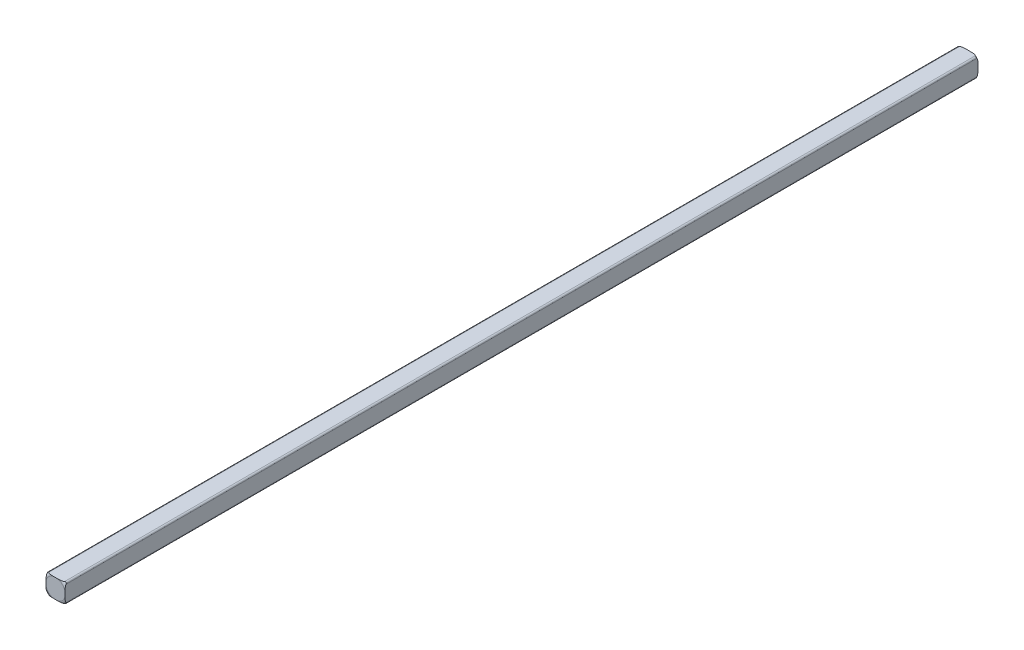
ISO-10303-21;
HEADER;
FILE_DESCRIPTION(('STEP AP214'),'2;1');
FILE_NAME('part.step','',(''),(''),'','','');
FILE_SCHEMA(('AUTOMOTIVE_DESIGN { 1 0 10303 214 1 1 1 1 }'));
ENDSEC;
DATA;
#1=APPLICATION_CONTEXT('core data for automotive mechanical design processes');
#2=APPLICATION_PROTOCOL_DEFINITION('international standard','automotive_design',2000,#1);
#3=PRODUCT_CONTEXT('',#1,'mechanical');
#4=PRODUCT('Part','Part','',(#3));
#5=PRODUCT_RELATED_PRODUCT_CATEGORY('part','',(#4));
#6=PRODUCT_DEFINITION_FORMATION('','',#4);
#7=PRODUCT_DEFINITION_CONTEXT('part definition',#1,'design');
#8=PRODUCT_DEFINITION('design','',#6,#7);
#9=PRODUCT_DEFINITION_SHAPE('','',#8);
#10=(LENGTH_UNIT() NAMED_UNIT(*) SI_UNIT(.MILLI.,.METRE.));
#11=(NAMED_UNIT(*) PLANE_ANGLE_UNIT() SI_UNIT($,.RADIAN.));
#12=(NAMED_UNIT(*) SI_UNIT($,.STERADIAN.) SOLID_ANGLE_UNIT());
#13=UNCERTAINTY_MEASURE_WITH_UNIT(LENGTH_MEASURE(1.E-05),#10,'distance_accuracy_value','');
#14=(GEOMETRIC_REPRESENTATION_CONTEXT(3) GLOBAL_UNCERTAINTY_ASSIGNED_CONTEXT((#13)) GLOBAL_UNIT_ASSIGNED_CONTEXT((#10,
#11,#12)) REPRESENTATION_CONTEXT('',''));
#15=CARTESIAN_POINT('',(0.,0.,0.));
#16=DIRECTION('',(0.,0.,1.));
#17=DIRECTION('',(1.,0.,0.));
#18=AXIS2_PLACEMENT_3D('',#15,#16,#17);
#19=CARTESIAN_POINT('',(0.,0.,151.765));
#20=DIRECTION('',(0.,0.,-1.));
#21=DIRECTION('',(1.,0.,0.));
#22=AXIS2_PLACEMENT_3D('',#19,#20,#21);
#23=TOROIDAL_SURFACE('',#22,1.63185378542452,0.634999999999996);
#24=CARTESIAN_POINT('',(-0.377876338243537,1.5875,152.4));
#25=CARTESIAN_POINT('',(-0.426955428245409,1.58750000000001,152.399972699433));
#26=CARTESIAN_POINT('',(-0.476057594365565,1.5875,152.399695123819));
#27=CARTESIAN_POINT('',(-0.574418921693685,1.5875,152.397747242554));
#28=CARTESIAN_POINT('',(-0.623677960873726,1.58749999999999,152.396071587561));
#29=CARTESIAN_POINT('',(-0.723913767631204,1.58750000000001,152.39031688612));
#30=CARTESIAN_POINT('',(-0.774886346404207,1.58750000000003,152.386150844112));
#31=CARTESIAN_POINT('',(-0.876340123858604,1.58749999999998,152.37416322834));
#32=CARTESIAN_POINT('',(-0.926821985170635,1.58749999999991,152.366347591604));
#33=CARTESIAN_POINT('',(-1.03968865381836,1.58750000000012,152.343126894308));
#34=CARTESIAN_POINT('',(-1.10179917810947,1.58750000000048,152.326287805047));
#35=CARTESIAN_POINT('',(-1.22173099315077,1.58749999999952,152.282177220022));
#36=CARTESIAN_POINT('',(-1.27959244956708,1.58749999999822,152.255024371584));
#37=CARTESIAN_POINT('',(-1.36359413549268,1.58749999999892,152.202783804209));
#38=CARTESIAN_POINT('',(-1.39245604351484,1.58749999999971,152.182082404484));
#39=CARTESIAN_POINT('',(-1.44669209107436,1.58750000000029,152.136431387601));
#40=CARTESIAN_POINT('',(-1.4720655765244,1.58750000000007,152.1114809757));
#41=CARTESIAN_POINT('',(-1.51404623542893,1.58749999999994,152.062038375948));
#42=CARTESIAN_POINT('',(-1.53141043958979,1.58749999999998,152.038192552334));
#43=CARTESIAN_POINT('',(-1.56193958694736,1.58750000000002,151.987988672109));
#44=CARTESIAN_POINT('',(-1.57511315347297,1.5875,151.961635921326));
#45=CARTESIAN_POINT('',(-1.59654474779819,1.5875,151.906864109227));
#46=CARTESIAN_POINT('',(-1.60478749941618,1.5875,151.878438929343));
#47=CARTESIAN_POINT('',(-1.61299775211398,1.5875,151.834926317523));
#48=CARTESIAN_POINT('',(-1.61504186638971,1.5875,151.820207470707));
#49=CARTESIAN_POINT('',(-1.61768666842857,1.5875,151.790631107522));
#50=CARTESIAN_POINT('',(-1.61828640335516,1.5875,151.775773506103));
#51=CARTESIAN_POINT('',(-1.61815024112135,1.5875,151.76091293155));
#52=B_SPLINE_CURVE_WITH_KNOTS('',3,(#24,#25,#26,#27,#28,#29,#30,#31,#32,#33,#34,#35,#36,#37,#38,
#39,#40,#41,#42,#43,#44,#45,#46,#47,#48,#49,#50,#51),.UNSPECIFIED.,.F.,.F.,(4,2,2,2,2,2,2,2,2,2,
2,2,2,4),(0.,0.147273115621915,0.295112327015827,0.448445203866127,0.601529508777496,
0.793946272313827,0.984213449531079,1.09043096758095,1.19666837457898,1.2848031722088,
1.37275541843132,1.46097875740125,1.50549646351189,1.55004352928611),.UNSPECIFIED.);
#53=CARTESIAN_POINT('',(-0.377876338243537,1.5875,152.4));
#54=VERTEX_POINT('',#53);
#55=CARTESIAN_POINT('',(-1.33349999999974,1.58749999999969,152.221499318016));
#56=VERTEX_POINT('',#55);
#57=EDGE_CURVE('E371',#54,#56,#52,.T.);
#58=ORIENTED_EDGE('',*,*,#57,.T.);
#59=CARTESIAN_POINT('',(-1.33349999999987,1.58749999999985,152.221499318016));
#60=CARTESIAN_POINT('',(-1.3469079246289,1.58748566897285,152.213190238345));
#61=CARTESIAN_POINT('',(-1.36046268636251,1.58643563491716,152.20497320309));
#62=CARTESIAN_POINT('',(-1.38783838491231,1.58201648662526,152.189246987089));
#63=CARTESIAN_POINT('',(-1.40166046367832,1.57861670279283,152.181748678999));
#64=CARTESIAN_POINT('',(-1.42521880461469,1.570587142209,152.170181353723));
#65=CARTESIAN_POINT('',(-1.43498690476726,1.56659229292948,152.165746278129));
#66=CARTESIAN_POINT('',(-1.45425932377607,1.55721249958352,152.158001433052));
#67=CARTESIAN_POINT('',(-1.46376466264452,1.55183414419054,152.154686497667));
#68=CARTESIAN_POINT('',(-1.48078992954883,1.5406427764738,152.14994940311));
#69=CARTESIAN_POINT('',(-1.48838416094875,1.53503704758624,152.148309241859));
#70=CARTESIAN_POINT('',(-1.50299443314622,1.52291375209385,152.146252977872));
#71=CARTESIAN_POINT('',(-1.51001060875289,1.51639639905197,152.145836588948));
#72=CARTESIAN_POINT('',(-1.52324184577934,1.50263078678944,152.146280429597));
#73=CARTESIAN_POINT('',(-1.5294566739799,1.49538231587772,152.14714102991));
#74=CARTESIAN_POINT('',(-1.54093535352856,1.48038761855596,152.150033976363));
#75=CARTESIAN_POINT('',(-1.54619862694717,1.47264109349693,152.152067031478));
#76=CARTESIAN_POINT('',(-1.55717012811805,1.45446300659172,152.157864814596));
#77=CARTESIAN_POINT('',(-1.5625287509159,1.44392996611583,152.161967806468));
#78=CARTESIAN_POINT('',(-1.57162418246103,1.4226499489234,152.171336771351));
#79=CARTESIAN_POINT('',(-1.57535394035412,1.4119022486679,152.176607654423));
#80=CARTESIAN_POINT('',(-1.58147222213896,1.38976321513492,152.188219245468));
#81=CARTESIAN_POINT('',(-1.58376977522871,1.37837092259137,152.194604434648));
#82=CARTESIAN_POINT('',(-1.58677095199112,1.35579141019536,152.207801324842));
#83=CARTESIAN_POINT('',(-1.58749208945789,1.34460332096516,152.214607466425));
#84=CARTESIAN_POINT('',(-1.5875,1.3335,152.221499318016));
#85=B_SPLINE_CURVE_WITH_KNOTS('',3,(#59,#60,#61,#62,#63,#64,#65,#66,#67,#68,#69,#70,#71,#72,#73,
#74,#75,#76,#77,#78,#79,#80,#81,#82,#83,#84),.UNSPECIFIED.,.F.,.F.,(4,2,2,2,2,2,2,2,2,2,2,2,4),
(0.,0.0474135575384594,0.0954579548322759,0.129685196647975,0.163752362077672,0.192367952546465,
0.220976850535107,0.249594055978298,0.278228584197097,0.315551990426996,0.353035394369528,
0.392706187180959,0.431933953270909),.UNSPECIFIED.);
#86=CARTESIAN_POINT('',(-1.5875,1.3335,152.221499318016));
#87=VERTEX_POINT('',#86);
#88=EDGE_CURVE('E13',#56,#87,#85,.T.);
#89=ORIENTED_EDGE('',*,*,#88,.T.);
#90=CARTESIAN_POINT('',(-1.5875,1.61815024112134,151.76091293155));
#91=CARTESIAN_POINT('',(-1.5875,1.61827741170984,151.774832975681));
#92=CARTESIAN_POINT('',(-1.5875,1.61775944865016,151.788750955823));
#93=CARTESIAN_POINT('',(-1.5875,1.61545341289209,151.816474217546));
#94=CARTESIAN_POINT('',(-1.5875,1.61366599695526,151.83027955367));
#95=CARTESIAN_POINT('',(-1.5875,1.60646537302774,151.871178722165));
#96=CARTESIAN_POINT('',(-1.5875,1.59921496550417,151.897968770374));
#97=CARTESIAN_POINT('',(-1.5875,1.58026897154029,151.949840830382));
#98=CARTESIAN_POINT('',(-1.5875,1.56858090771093,151.974925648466));
#99=CARTESIAN_POINT('',(-1.5875,1.54138158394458,152.022961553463));
#100=CARTESIAN_POINT('',(-1.5875,1.52586349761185,152.045908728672));
#101=CARTESIAN_POINT('',(-1.5875,1.48463218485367,152.098302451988));
#102=CARTESIAN_POINT('',(-1.5875,1.45735516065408,152.126519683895));
#103=CARTESIAN_POINT('',(-1.5875,1.39838558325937,152.177801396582));
#104=CARTESIAN_POINT('',(-1.5875,1.36668795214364,152.20085987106));
#105=CARTESIAN_POINT('',(-1.5875,1.28789122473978,152.249863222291));
#106=CARTESIAN_POINT('',(-1.5875,1.23946785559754,152.273658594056));
#107=CARTESIAN_POINT('',(-1.5875,1.13931384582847,152.313649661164));
#108=CARTESIAN_POINT('',(-1.5875,1.08756118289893,152.329787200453));
#109=CARTESIAN_POINT('',(-1.5875,0.98070328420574,152.356377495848));
#110=CARTESIAN_POINT('',(-1.5875,0.925544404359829,152.366605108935));
#111=CARTESIAN_POINT('',(-1.5875,0.81445134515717,152.382238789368));
#112=CARTESIAN_POINT('',(-1.5875,0.75851548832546,152.387631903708));
#113=CARTESIAN_POINT('',(-1.5875,0.648312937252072,152.3950507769));
#114=CARTESIAN_POINT('',(-1.5875,0.594052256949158,152.397182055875));
#115=CARTESIAN_POINT('',(-1.5875,0.485806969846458,152.399631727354));
#116=CARTESIAN_POINT('',(-1.5875,0.431822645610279,152.399960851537));
#117=CARTESIAN_POINT('',(-1.5875,0.377876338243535,152.4));
#118=B_SPLINE_CURVE_WITH_KNOTS('',3,(#90,#91,#92,#93,#94,#95,#96,#97,#98,#99,#100,#101,#102,
#103,#104,#105,#106,#107,#108,#109,#110,#111,#112,#113,#114,#115,#116,#117),.UNSPECIFIED.,.F.,
.F.,(4,2,2,2,2,2,2,2,2,2,2,2,2,4),(0.,0.0417318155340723,0.0834420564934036,0.166232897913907,
0.248884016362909,0.331683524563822,0.448675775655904,0.565803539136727,0.726767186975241,
0.888934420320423,1.05692964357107,1.22537364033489,1.38824385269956,1.55014312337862),.UNSPECIFIED.);
#119=CARTESIAN_POINT('',(-1.5875,0.377876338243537,152.4));
#120=VERTEX_POINT('',#119);
#121=EDGE_CURVE('E374',#87,#120,#118,.T.);
#122=ORIENTED_EDGE('',*,*,#121,.T.);
#123=CARTESIAN_POINT('',(0.,0.,152.4));
#124=DIRECTION('',(0.,0.,-1.));
#125=DIRECTION('',(-0.97282000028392,0.231562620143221,0.));
#126=AXIS2_PLACEMENT_3D('',#123,#124,#125);
#127=CIRCLE('',#126,1.63185378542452);
#128=EDGE_CURVE('E525',#120,#54,#127,.T.);
#129=ORIENTED_EDGE('',*,*,#128,.T.);
#130=EDGE_LOOP('',(#58,#89,#122,#129));
#131=FACE_BOUND('',#130,.T.);
#132=ADVANCED_FACE('F46',(#131),#23,.T.);
#133=CARTESIAN_POINT('',(0.,0.,151.765));
#134=DIRECTION('',(0.,0.,-1.));
#135=DIRECTION('',(1.,0.,0.));
#136=AXIS2_PLACEMENT_3D('',#133,#134,#135);
#137=TOROIDAL_SURFACE('',#136,1.63185378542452,0.634999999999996);
#138=CARTESIAN_POINT('',(0.377876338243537,-1.5875,152.4));
#139=CARTESIAN_POINT('',(0.426955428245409,-1.58750000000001,152.399972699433));
#140=CARTESIAN_POINT('',(0.476057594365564,-1.5875,152.399695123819));
#141=CARTESIAN_POINT('',(0.574418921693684,-1.5875,152.397747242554));
#142=CARTESIAN_POINT('',(0.623677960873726,-1.58749999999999,152.396071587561));
#143=CARTESIAN_POINT('',(0.723913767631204,-1.58750000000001,152.39031688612));
#144=CARTESIAN_POINT('',(0.774886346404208,-1.58750000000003,152.386150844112));
#145=CARTESIAN_POINT('',(0.876340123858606,-1.58749999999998,152.37416322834));
#146=CARTESIAN_POINT('',(0.926821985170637,-1.58749999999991,152.366347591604));
#147=CARTESIAN_POINT('',(1.03968865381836,-1.58750000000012,152.343126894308));
#148=CARTESIAN_POINT('',(1.10179917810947,-1.58750000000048,152.326287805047));
#149=CARTESIAN_POINT('',(1.22173099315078,-1.58749999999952,152.282177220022));
#150=CARTESIAN_POINT('',(1.27959244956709,-1.58749999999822,152.255024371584));
#151=CARTESIAN_POINT('',(1.36359413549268,-1.58749999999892,152.202783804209));
#152=CARTESIAN_POINT('',(1.39245604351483,-1.58749999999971,152.182082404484));
#153=CARTESIAN_POINT('',(1.44669209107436,-1.58750000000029,152.136431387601));
#154=CARTESIAN_POINT('',(1.4720655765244,-1.58750000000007,152.1114809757));
#155=CARTESIAN_POINT('',(1.51404623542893,-1.58749999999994,152.062038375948));
#156=CARTESIAN_POINT('',(1.53141043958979,-1.58749999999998,152.038192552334));
#157=CARTESIAN_POINT('',(1.56193958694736,-1.58750000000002,151.987988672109));
#158=CARTESIAN_POINT('',(1.57511315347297,-1.5875,151.961635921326));
#159=CARTESIAN_POINT('',(1.59654474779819,-1.5875,151.906864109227));
#160=CARTESIAN_POINT('',(1.60478749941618,-1.5875,151.878438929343));
#161=CARTESIAN_POINT('',(1.61299775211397,-1.5875,151.834926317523));
#162=CARTESIAN_POINT('',(1.61504186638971,-1.5875,151.820207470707));
#163=CARTESIAN_POINT('',(1.61768666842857,-1.5875,151.790631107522));
#164=CARTESIAN_POINT('',(1.61828640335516,-1.5875,151.775773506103));
#165=CARTESIAN_POINT('',(1.61815024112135,-1.5875,151.76091293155));
#166=B_SPLINE_CURVE_WITH_KNOTS('',3,(#138,#139,#140,#141,#142,#143,#144,#145,#146,#147,#148,
#149,#150,#151,#152,#153,#154,#155,#156,#157,#158,#159,#160,#161,#162,#163,#164,#165),
.UNSPECIFIED.,.F.,.F.,(4,2,2,2,2,2,2,2,2,2,2,2,2,4),(0.,0.147273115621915,0.295112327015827,
0.448445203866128,0.601529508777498,0.793946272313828,0.98421344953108,1.09043096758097,
1.19666837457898,1.28480317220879,1.37275541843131,1.46097875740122,1.50549646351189,
1.55004352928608),.UNSPECIFIED.);
#167=CARTESIAN_POINT('',(0.377876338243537,-1.5875,152.4));
#168=VERTEX_POINT('',#167);
#169=CARTESIAN_POINT('',(1.33349999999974,-1.58749999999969,152.221499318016));
#170=VERTEX_POINT('',#169);
#171=EDGE_CURVE('E500',#168,#170,#166,.T.);
#172=ORIENTED_EDGE('',*,*,#171,.T.);
#173=CARTESIAN_POINT('',(1.33349999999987,-1.58749999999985,152.221499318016));
#174=CARTESIAN_POINT('',(1.3469079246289,-1.58748566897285,152.213190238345));
#175=CARTESIAN_POINT('',(1.36046268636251,-1.58643563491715,152.20497320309));
#176=CARTESIAN_POINT('',(1.38783838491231,-1.58201648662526,152.189246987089));
#177=CARTESIAN_POINT('',(1.40166046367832,-1.57861670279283,152.181748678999));
#178=CARTESIAN_POINT('',(1.42521880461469,-1.570587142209,152.170181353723));
#179=CARTESIAN_POINT('',(1.43498690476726,-1.56659229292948,152.165746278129));
#180=CARTESIAN_POINT('',(1.45425932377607,-1.55721249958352,152.158001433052));
#181=CARTESIAN_POINT('',(1.46376466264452,-1.55183414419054,152.154686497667));
#182=CARTESIAN_POINT('',(1.48078992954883,-1.5406427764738,152.14994940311));
#183=CARTESIAN_POINT('',(1.48838416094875,-1.53503704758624,152.148309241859));
#184=CARTESIAN_POINT('',(1.50299443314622,-1.52291375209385,152.146252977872));
#185=CARTESIAN_POINT('',(1.51001060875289,-1.51639639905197,152.145836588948));
#186=CARTESIAN_POINT('',(1.52324184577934,-1.50263078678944,152.146280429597));
#187=CARTESIAN_POINT('',(1.5294566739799,-1.49538231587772,152.14714102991));
#188=CARTESIAN_POINT('',(1.54093535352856,-1.48038761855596,152.150033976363));
#189=CARTESIAN_POINT('',(1.54619862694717,-1.47264109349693,152.152067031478));
#190=CARTESIAN_POINT('',(1.55717012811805,-1.45446300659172,152.157864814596));
#191=CARTESIAN_POINT('',(1.5625287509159,-1.44392996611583,152.161967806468));
#192=CARTESIAN_POINT('',(1.57162418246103,-1.4226499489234,152.171336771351));
#193=CARTESIAN_POINT('',(1.57535394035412,-1.4119022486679,152.176607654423));
#194=CARTESIAN_POINT('',(1.58147222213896,-1.38976321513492,152.188219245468));
#195=CARTESIAN_POINT('',(1.58376977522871,-1.37837092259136,152.194604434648));
#196=CARTESIAN_POINT('',(1.58677095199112,-1.35579141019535,152.207801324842));
#197=CARTESIAN_POINT('',(1.58749208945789,-1.34460332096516,152.214607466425));
#198=CARTESIAN_POINT('',(1.5875,-1.3335,152.221499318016));
#199=B_SPLINE_CURVE_WITH_KNOTS('',3,(#173,#174,#175,#176,#177,#178,#179,#180,#181,#182,#183,
#184,#185,#186,#187,#188,#189,#190,#191,#192,#193,#194,#195,#196,#197,#198),.UNSPECIFIED.,.F.,
.F.,(4,2,2,2,2,2,2,2,2,2,2,2,4),(0.,0.0474135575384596,0.0954579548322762,0.129685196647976,
0.163752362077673,0.192367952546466,0.220976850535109,0.2495940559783,0.278228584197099,
0.315551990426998,0.35303539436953,0.39270618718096,0.43193395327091),.UNSPECIFIED.);
#200=CARTESIAN_POINT('',(1.5875,-1.3335,152.221499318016));
#201=VERTEX_POINT('',#200);
#202=EDGE_CURVE('E754',#170,#201,#199,.T.);
#203=ORIENTED_EDGE('',*,*,#202,.T.);
#204=CARTESIAN_POINT('',(1.5875,-1.61815024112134,151.76091293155));
#205=CARTESIAN_POINT('',(1.5875,-1.61827741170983,151.774832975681));
#206=CARTESIAN_POINT('',(1.5875,-1.61775944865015,151.788750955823));
#207=CARTESIAN_POINT('',(1.5875,-1.61545341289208,151.816474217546));
#208=CARTESIAN_POINT('',(1.5875,-1.61366599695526,151.83027955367));
#209=CARTESIAN_POINT('',(1.5875,-1.60646537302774,151.871178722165));
#210=CARTESIAN_POINT('',(1.5875,-1.59921496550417,151.897968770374));
#211=CARTESIAN_POINT('',(1.5875,-1.58026897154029,151.949840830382));
#212=CARTESIAN_POINT('',(1.5875,-1.56858090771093,151.974925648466));
#213=CARTESIAN_POINT('',(1.5875,-1.54138158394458,152.022961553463));
#214=CARTESIAN_POINT('',(1.5875,-1.52586349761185,152.045908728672));
#215=CARTESIAN_POINT('',(1.5875,-1.48463218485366,152.098302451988));
#216=CARTESIAN_POINT('',(1.5875,-1.45735516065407,152.126519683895));
#217=CARTESIAN_POINT('',(1.5875,-1.39838558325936,152.177801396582));
#218=CARTESIAN_POINT('',(1.5875,-1.36668795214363,152.20085987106));
#219=CARTESIAN_POINT('',(1.5875,-1.28789122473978,152.249863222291));
#220=CARTESIAN_POINT('',(1.5875,-1.23946785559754,152.273658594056));
#221=CARTESIAN_POINT('',(1.5875,-1.13931384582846,152.313649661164));
#222=CARTESIAN_POINT('',(1.5875,-1.08756118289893,152.329787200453));
#223=CARTESIAN_POINT('',(1.5875,-0.980703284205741,152.356377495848));
#224=CARTESIAN_POINT('',(1.5875,-0.925544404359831,152.366605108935));
#225=CARTESIAN_POINT('',(1.5875,-0.814451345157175,152.382238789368));
#226=CARTESIAN_POINT('',(1.5875,-0.758515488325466,152.387631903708));
#227=CARTESIAN_POINT('',(1.5875,-0.648312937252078,152.3950507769));
#228=CARTESIAN_POINT('',(1.5875,-0.594052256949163,152.397182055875));
#229=CARTESIAN_POINT('',(1.5875,-0.48580696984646,152.399631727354));
#230=CARTESIAN_POINT('',(1.5875,-0.43182264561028,152.399960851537));
#231=CARTESIAN_POINT('',(1.5875,-0.377876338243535,152.4));
#232=B_SPLINE_CURVE_WITH_KNOTS('',3,(#204,#205,#206,#207,#208,#209,#210,#211,#212,#213,#214,
#215,#216,#217,#218,#219,#220,#221,#222,#223,#224,#225,#226,#227,#228,#229,#230,#231),
.UNSPECIFIED.,.F.,.F.,(4,2,2,2,2,2,2,2,2,2,2,2,2,4),(0.,0.0417318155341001,0.0834420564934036,
0.166232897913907,0.248884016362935,0.331683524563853,0.448675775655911,0.56580353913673,
0.726767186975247,0.888934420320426,1.05692964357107,1.22537364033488,1.38824385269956,
1.55014312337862),.UNSPECIFIED.);
#233=CARTESIAN_POINT('',(1.5875,-0.377876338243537,152.4));
#234=VERTEX_POINT('',#233);
#235=EDGE_CURVE('E716',#201,#234,#232,.T.);
#236=ORIENTED_EDGE('',*,*,#235,.T.);
#237=CARTESIAN_POINT('',(0.,0.,152.4));
#238=DIRECTION('',(0.,0.,-1.));
#239=DIRECTION('',(0.97282000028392,-0.231562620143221,0.));
#240=AXIS2_PLACEMENT_3D('',#237,#238,#239);
#241=CIRCLE('',#240,1.63185378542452);
#242=EDGE_CURVE('E518',#234,#168,#241,.T.);
#243=ORIENTED_EDGE('',*,*,#242,.T.);
#244=EDGE_LOOP('',(#172,#203,#236,#243));
#245=FACE_BOUND('',#244,.T.);
#246=ADVANCED_FACE('F474',(#245),#137,.T.);
#247=CARTESIAN_POINT('',(0.,0.,151.765));
#248=DIRECTION('',(0.,0.,-1.));
#249=DIRECTION('',(1.,0.,0.));
#250=AXIS2_PLACEMENT_3D('',#247,#248,#249);
#251=TOROIDAL_SURFACE('',#250,1.63185378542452,0.634999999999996);
#252=CARTESIAN_POINT('',(-1.5875,-0.377876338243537,152.4));
#253=CARTESIAN_POINT('',(-1.58750000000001,-0.426955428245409,152.399972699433));
#254=CARTESIAN_POINT('',(-1.5875,-0.476057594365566,152.399695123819));
#255=CARTESIAN_POINT('',(-1.5875,-0.574418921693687,152.397747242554));
#256=CARTESIAN_POINT('',(-1.58749999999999,-0.623677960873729,152.396071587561));
#257=CARTESIAN_POINT('',(-1.58750000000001,-0.723913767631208,152.39031688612));
#258=CARTESIAN_POINT('',(-1.58750000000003,-0.774886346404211,152.386150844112));
#259=CARTESIAN_POINT('',(-1.58749999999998,-0.876340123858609,152.37416322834));
#260=CARTESIAN_POINT('',(-1.58749999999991,-0.92682198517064,152.366347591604));
#261=CARTESIAN_POINT('',(-1.58750000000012,-1.03968865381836,152.343126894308));
#262=CARTESIAN_POINT('',(-1.58750000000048,-1.10179917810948,152.326287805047));
#263=CARTESIAN_POINT('',(-1.58749999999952,-1.22173099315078,152.282177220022));
#264=CARTESIAN_POINT('',(-1.58749999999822,-1.27959244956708,152.255024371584));
#265=CARTESIAN_POINT('',(-1.58749999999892,-1.36359413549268,152.202783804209));
#266=CARTESIAN_POINT('',(-1.58749999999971,-1.39245604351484,152.182082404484));
#267=CARTESIAN_POINT('',(-1.58750000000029,-1.44669209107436,152.136431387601));
#268=CARTESIAN_POINT('',(-1.58750000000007,-1.4720655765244,152.1114809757));
#269=CARTESIAN_POINT('',(-1.58749999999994,-1.51404623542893,152.062038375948));
#270=CARTESIAN_POINT('',(-1.58749999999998,-1.53141043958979,152.038192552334));
#271=CARTESIAN_POINT('',(-1.58750000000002,-1.56193958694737,151.987988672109));
#272=CARTESIAN_POINT('',(-1.5875,-1.57511315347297,151.961635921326));
#273=CARTESIAN_POINT('',(-1.5875,-1.5965447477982,151.906864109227));
#274=CARTESIAN_POINT('',(-1.5875,-1.60478749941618,151.878438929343));
#275=CARTESIAN_POINT('',(-1.5875,-1.61299775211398,151.834926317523));
#276=CARTESIAN_POINT('',(-1.5875,-1.61504186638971,151.820207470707));
#277=CARTESIAN_POINT('',(-1.5875,-1.61768666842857,151.790631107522));
#278=CARTESIAN_POINT('',(-1.5875,-1.61828640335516,151.775773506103));
#279=CARTESIAN_POINT('',(-1.5875,-1.61815024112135,151.76091293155));
#280=B_SPLINE_CURVE_WITH_KNOTS('',3,(#252,#253,#254,#255,#256,#257,#258,#259,#260,#261,#262,
#263,#264,#265,#266,#267,#268,#269,#270,#271,#272,#273,#274,#275,#276,#277,#278,#279),
.UNSPECIFIED.,.F.,.F.,(4,2,2,2,2,2,2,2,2,2,2,2,2,4),(0.,0.147273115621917,0.295112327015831,
0.448445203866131,0.601529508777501,0.793946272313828,0.984213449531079,1.09043096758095,
1.19666837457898,1.2848031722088,1.37275541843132,1.46097875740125,1.50549646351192,
1.55004352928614),.UNSPECIFIED.);
#281=CARTESIAN_POINT('',(-1.5875,-0.377876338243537,152.4));
#282=VERTEX_POINT('',#281);
#283=CARTESIAN_POINT('',(-1.58749999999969,-1.33349999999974,152.221499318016));
#284=VERTEX_POINT('',#283);
#285=EDGE_CURVE('E566',#282,#284,#280,.T.);
#286=ORIENTED_EDGE('',*,*,#285,.T.);
#287=CARTESIAN_POINT('',(-1.58749999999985,-1.33349999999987,152.221499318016));
#288=CARTESIAN_POINT('',(-1.58748566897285,-1.3469079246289,152.213190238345));
#289=CARTESIAN_POINT('',(-1.58643563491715,-1.36046268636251,152.20497320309));
#290=CARTESIAN_POINT('',(-1.58201648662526,-1.38783838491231,152.189246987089));
#291=CARTESIAN_POINT('',(-1.57861670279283,-1.40166046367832,152.181748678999));
#292=CARTESIAN_POINT('',(-1.570587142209,-1.42521880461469,152.170181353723));
#293=CARTESIAN_POINT('',(-1.56659229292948,-1.43498690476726,152.165746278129));
#294=CARTESIAN_POINT('',(-1.55721249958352,-1.45425932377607,152.158001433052));
#295=CARTESIAN_POINT('',(-1.55183414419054,-1.46376466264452,152.154686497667));
#296=CARTESIAN_POINT('',(-1.5406427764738,-1.48078992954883,152.14994940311));
#297=CARTESIAN_POINT('',(-1.53503704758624,-1.48838416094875,152.148309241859));
#298=CARTESIAN_POINT('',(-1.52291375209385,-1.50299443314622,152.146252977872));
#299=CARTESIAN_POINT('',(-1.51639639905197,-1.51001060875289,152.145836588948));
#300=CARTESIAN_POINT('',(-1.50263078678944,-1.52324184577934,152.146280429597));
#301=CARTESIAN_POINT('',(-1.49538231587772,-1.5294566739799,152.14714102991));
#302=CARTESIAN_POINT('',(-1.48038761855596,-1.54093535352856,152.150033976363));
#303=CARTESIAN_POINT('',(-1.47264109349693,-1.54619862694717,152.152067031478));
#304=CARTESIAN_POINT('',(-1.45446300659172,-1.55717012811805,152.157864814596));
#305=CARTESIAN_POINT('',(-1.44392996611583,-1.5625287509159,152.161967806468));
#306=CARTESIAN_POINT('',(-1.4226499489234,-1.57162418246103,152.171336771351));
#307=CARTESIAN_POINT('',(-1.4119022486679,-1.57535394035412,152.176607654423));
#308=CARTESIAN_POINT('',(-1.38976321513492,-1.58147222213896,152.188219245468));
#309=CARTESIAN_POINT('',(-1.37837092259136,-1.58376977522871,152.194604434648));
#310=CARTESIAN_POINT('',(-1.35579141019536,-1.58677095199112,152.207801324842));
#311=CARTESIAN_POINT('',(-1.34460332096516,-1.58749208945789,152.214607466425));
#312=CARTESIAN_POINT('',(-1.3335,-1.5875,152.221499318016));
#313=B_SPLINE_CURVE_WITH_KNOTS('',3,(#287,#288,#289,#290,#291,#292,#293,#294,#295,#296,#297,
#298,#299,#300,#301,#302,#303,#304,#305,#306,#307,#308,#309,#310,#311,#312),.UNSPECIFIED.,.F.,
.F.,(4,2,2,2,2,2,2,2,2,2,2,2,4),(0.,0.0474135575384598,0.095457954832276,0.129685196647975,
0.163752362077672,0.192367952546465,0.220976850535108,0.249594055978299,0.278228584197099,
0.315551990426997,0.353035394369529,0.39270618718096,0.431933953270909),.UNSPECIFIED.);
#314=CARTESIAN_POINT('',(-1.3335,-1.5875,152.221499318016));
#315=VERTEX_POINT('',#314);
#316=EDGE_CURVE('E737',#284,#315,#313,.T.);
#317=ORIENTED_EDGE('',*,*,#316,.T.);
#318=CARTESIAN_POINT('',(-1.61815024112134,-1.5875,151.76091293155));
#319=CARTESIAN_POINT('',(-1.61827741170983,-1.5875,151.774832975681));
#320=CARTESIAN_POINT('',(-1.61775944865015,-1.5875,151.788750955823));
#321=CARTESIAN_POINT('',(-1.61545341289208,-1.5875,151.816474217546));
#322=CARTESIAN_POINT('',(-1.61366599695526,-1.5875,151.83027955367));
#323=CARTESIAN_POINT('',(-1.60646537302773,-1.5875,151.871178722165));
#324=CARTESIAN_POINT('',(-1.59921496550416,-1.5875,151.897968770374));
#325=CARTESIAN_POINT('',(-1.58026897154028,-1.5875,151.949840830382));
#326=CARTESIAN_POINT('',(-1.56858090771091,-1.5875,151.974925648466));
#327=CARTESIAN_POINT('',(-1.54138158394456,-1.5875,152.022961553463));
#328=CARTESIAN_POINT('',(-1.52586349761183,-1.5875,152.045908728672));
#329=CARTESIAN_POINT('',(-1.48463218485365,-1.5875,152.098302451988));
#330=CARTESIAN_POINT('',(-1.45735516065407,-1.5875,152.126519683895));
#331=CARTESIAN_POINT('',(-1.39838558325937,-1.5875,152.177801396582));
#332=CARTESIAN_POINT('',(-1.36668795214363,-1.5875,152.20085987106));
#333=CARTESIAN_POINT('',(-1.28789122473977,-1.5875,152.249863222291));
#334=CARTESIAN_POINT('',(-1.23946785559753,-1.5875,152.273658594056));
#335=CARTESIAN_POINT('',(-1.13931384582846,-1.5875,152.313649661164));
#336=CARTESIAN_POINT('',(-1.08756118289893,-1.5875,152.329787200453));
#337=CARTESIAN_POINT('',(-0.980703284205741,-1.5875,152.356377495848));
#338=CARTESIAN_POINT('',(-0.925544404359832,-1.5875,152.366605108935));
#339=CARTESIAN_POINT('',(-0.814451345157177,-1.5875,152.382238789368));
#340=CARTESIAN_POINT('',(-0.758515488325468,-1.5875,152.387631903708));
#341=CARTESIAN_POINT('',(-0.648312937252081,-1.5875,152.3950507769));
#342=CARTESIAN_POINT('',(-0.594052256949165,-1.5875,152.397182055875));
#343=CARTESIAN_POINT('',(-0.485806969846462,-1.5875,152.399631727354));
#344=CARTESIAN_POINT('',(-0.431822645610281,-1.5875,152.399960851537));
#345=CARTESIAN_POINT('',(-0.377876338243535,-1.5875,152.4));
#346=B_SPLINE_CURVE_WITH_KNOTS('',3,(#318,#319,#320,#321,#322,#323,#324,#325,#326,#327,#328,
#329,#330,#331,#332,#333,#334,#335,#336,#337,#338,#339,#340,#341,#342,#343,#344,#345),
.UNSPECIFIED.,.F.,.F.,(4,2,2,2,2,2,2,2,2,2,2,2,2,4),(0.,0.0417318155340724,0.083442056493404,
0.166232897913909,0.24888401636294,0.331683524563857,0.448675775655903,0.565803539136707,
0.726767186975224,0.888934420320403,1.05692964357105,1.22537364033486,1.38824385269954,
1.5501431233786),.UNSPECIFIED.);
#347=CARTESIAN_POINT('',(-0.377876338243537,-1.5875,152.4));
#348=VERTEX_POINT('',#347);
#349=EDGE_CURVE('E704',#315,#348,#346,.T.);
#350=ORIENTED_EDGE('',*,*,#349,.T.);
#351=CARTESIAN_POINT('',(0.,0.,152.4));
#352=DIRECTION('',(0.,0.,-1.));
#353=DIRECTION('',(-0.231562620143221,-0.97282000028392,0.));
#354=AXIS2_PLACEMENT_3D('',#351,#352,#353);
#355=CIRCLE('',#354,1.63185378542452);
#356=EDGE_CURVE('E648',#348,#282,#355,.T.);
#357=ORIENTED_EDGE('',*,*,#356,.T.);
#358=EDGE_LOOP('',(#286,#317,#350,#357));
#359=FACE_BOUND('',#358,.T.);
#360=ADVANCED_FACE('F477',(#359),#251,.T.);
#361=CARTESIAN_POINT('',(-1.5875,1.5875,152.4));
#362=DIRECTION('',(0.,0.,-1.));
#363=DIRECTION('',(-1.,0.,0.));
#364=AXIS2_PLACEMENT_3D('',#361,#362,#363);
#365=PLANE('',#364);
#366=ORIENTED_EDGE('',*,*,#356,.F.);
#367=DIRECTION('',(-1.,0.,0.));
#368=VECTOR('',#367,1.);
#369=CARTESIAN_POINT('',(-1.5875,-1.5875,152.4));
#370=LINE('',#369,#368);
#371=EDGE_CURVE('E511',#168,#348,#370,.T.);
#372=ORIENTED_EDGE('',*,*,#371,.F.);
#373=ORIENTED_EDGE('',*,*,#242,.F.);
#374=DIRECTION('',(0.,1.,0.));
#375=VECTOR('',#374,1.);
#376=CARTESIAN_POINT('',(1.5875,1.5875,152.4));
#377=LINE('',#376,#375);
#378=CARTESIAN_POINT('',(1.5875,0.377876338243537,152.4));
#379=VERTEX_POINT('',#378);
#380=EDGE_CURVE('E513',#379,#234,#377,.F.);
#381=ORIENTED_EDGE('',*,*,#380,.F.);
#382=CARTESIAN_POINT('',(0.,0.,152.4));
#383=DIRECTION('',(0.,0.,-1.));
#384=DIRECTION('',(0.231562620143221,0.97282000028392,0.));
#385=AXIS2_PLACEMENT_3D('',#382,#383,#384);
#386=CIRCLE('',#385,1.63185378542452);
#387=CARTESIAN_POINT('',(0.377876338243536,1.5875,152.4));
#388=VERTEX_POINT('',#387);
#389=EDGE_CURVE('E531',#388,#379,#386,.T.);
#390=ORIENTED_EDGE('',*,*,#389,.F.);
#391=DIRECTION('',(-1.,0.,0.));
#392=VECTOR('',#391,1.);
#393=CARTESIAN_POINT('',(-1.5875,1.5875,152.4));
#394=LINE('',#393,#392);
#395=EDGE_CURVE('E519',#54,#388,#394,.F.);
#396=ORIENTED_EDGE('',*,*,#395,.F.);
#397=ORIENTED_EDGE('',*,*,#128,.F.);
#398=DIRECTION('',(0.,1.,0.));
#399=VECTOR('',#398,1.);
#400=CARTESIAN_POINT('',(-1.5875,1.5875,152.4));
#401=LINE('',#400,#399);
#402=EDGE_CURVE('E643',#282,#120,#401,.T.);
#403=ORIENTED_EDGE('',*,*,#402,.F.);
#404=EDGE_LOOP('',(#366,#372,#373,#381,#390,#396,#397,#403));
#405=FACE_BOUND('',#404,.T.);
#406=ADVANCED_FACE('F546',(#405),#365,.F.);
#407=CARTESIAN_POINT('',(0.,0.,151.765));
#408=DIRECTION('',(0.,0.,-1.));
#409=DIRECTION('',(1.,0.,0.));
#410=AXIS2_PLACEMENT_3D('',#407,#408,#409);
#411=TOROIDAL_SURFACE('',#410,1.63185378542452,0.634999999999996);
#412=CARTESIAN_POINT('',(1.5875,0.377876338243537,152.4));
#413=CARTESIAN_POINT('',(1.58750000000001,0.426955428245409,152.399972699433));
#414=CARTESIAN_POINT('',(1.5875,0.476057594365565,152.399695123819));
#415=CARTESIAN_POINT('',(1.5875,0.574418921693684,152.397747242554));
#416=CARTESIAN_POINT('',(1.58749999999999,0.623677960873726,152.396071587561));
#417=CARTESIAN_POINT('',(1.58750000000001,0.723913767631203,152.39031688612));
#418=CARTESIAN_POINT('',(1.58750000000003,0.774886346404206,152.386150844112));
#419=CARTESIAN_POINT('',(1.58749999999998,0.876340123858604,152.37416322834));
#420=CARTESIAN_POINT('',(1.58749999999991,0.926821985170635,152.366347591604));
#421=CARTESIAN_POINT('',(1.58750000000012,1.03968865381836,152.343126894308));
#422=CARTESIAN_POINT('',(1.58750000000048,1.10179917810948,152.326287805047));
#423=CARTESIAN_POINT('',(1.58749999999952,1.22173099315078,152.282177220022));
#424=CARTESIAN_POINT('',(1.58749999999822,1.27959244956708,152.255024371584));
#425=CARTESIAN_POINT('',(1.58749999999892,1.36359413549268,152.202783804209));
#426=CARTESIAN_POINT('',(1.58749999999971,1.39245604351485,152.182082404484));
#427=CARTESIAN_POINT('',(1.58750000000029,1.44669209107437,152.136431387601));
#428=CARTESIAN_POINT('',(1.58750000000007,1.4720655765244,152.1114809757));
#429=CARTESIAN_POINT('',(1.58749999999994,1.51404623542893,152.062038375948));
#430=CARTESIAN_POINT('',(1.58749999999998,1.53141043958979,152.038192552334));
#431=CARTESIAN_POINT('',(1.58750000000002,1.56193958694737,151.987988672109));
#432=CARTESIAN_POINT('',(1.5875,1.57511315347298,151.961635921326));
#433=CARTESIAN_POINT('',(1.5875,1.59654474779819,151.906864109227));
#434=CARTESIAN_POINT('',(1.5875,1.60478749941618,151.878438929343));
#435=CARTESIAN_POINT('',(1.5875,1.61299775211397,151.834926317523));
#436=CARTESIAN_POINT('',(1.5875,1.61504186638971,151.820207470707));
#437=CARTESIAN_POINT('',(1.5875,1.61768666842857,151.790631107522));
#438=CARTESIAN_POINT('',(1.5875,1.61828640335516,151.775773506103));
#439=CARTESIAN_POINT('',(1.5875,1.61815024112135,151.76091293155));
#440=B_SPLINE_CURVE_WITH_KNOTS('',3,(#412,#413,#414,#415,#416,#417,#418,#419,#420,#421,#422,
#423,#424,#425,#426,#427,#428,#429,#430,#431,#432,#433,#434,#435,#436,#437,#438,#439),
.UNSPECIFIED.,.F.,.F.,(4,2,2,2,2,2,2,2,2,2,2,2,2,4),(0.,0.147273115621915,0.295112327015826,
0.448445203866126,0.601529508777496,0.793946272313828,0.984213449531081,1.09043096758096,
1.19666837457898,1.2848031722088,1.37275541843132,1.46097875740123,1.50549646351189,
1.55004352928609),.UNSPECIFIED.);
#441=CARTESIAN_POINT('',(1.58749999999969,1.33349999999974,152.221499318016));
#442=VERTEX_POINT('',#441);
#443=EDGE_CURVE('E565',#379,#442,#440,.T.);
#444=ORIENTED_EDGE('',*,*,#443,.T.);
#445=CARTESIAN_POINT('',(1.58749999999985,1.33349999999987,152.221499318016));
#446=CARTESIAN_POINT('',(1.58748566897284,1.3469079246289,152.213190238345));
#447=CARTESIAN_POINT('',(1.58643563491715,1.36046268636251,152.20497320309));
#448=CARTESIAN_POINT('',(1.58201648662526,1.38783838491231,152.189246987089));
#449=CARTESIAN_POINT('',(1.57861670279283,1.40166046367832,152.181748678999));
#450=CARTESIAN_POINT('',(1.570587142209,1.42521880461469,152.170181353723));
#451=CARTESIAN_POINT('',(1.56659229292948,1.43498690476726,152.165746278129));
#452=CARTESIAN_POINT('',(1.55721249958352,1.45425932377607,152.158001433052));
#453=CARTESIAN_POINT('',(1.55183414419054,1.46376466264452,152.154686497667));
#454=CARTESIAN_POINT('',(1.5406427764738,1.48078992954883,152.14994940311));
#455=CARTESIAN_POINT('',(1.53503704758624,1.48838416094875,152.148309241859));
#456=CARTESIAN_POINT('',(1.52291375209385,1.50299443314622,152.146252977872));
#457=CARTESIAN_POINT('',(1.51639639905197,1.51001060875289,152.145836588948));
#458=CARTESIAN_POINT('',(1.50263078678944,1.52324184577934,152.146280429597));
#459=CARTESIAN_POINT('',(1.49538231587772,1.5294566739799,152.14714102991));
#460=CARTESIAN_POINT('',(1.48038761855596,1.54093535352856,152.150033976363));
#461=CARTESIAN_POINT('',(1.47264109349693,1.54619862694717,152.152067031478));
#462=CARTESIAN_POINT('',(1.45446300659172,1.55717012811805,152.157864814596));
#463=CARTESIAN_POINT('',(1.44392996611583,1.5625287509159,152.161967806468));
#464=CARTESIAN_POINT('',(1.4226499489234,1.57162418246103,152.171336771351));
#465=CARTESIAN_POINT('',(1.4119022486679,1.57535394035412,152.176607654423));
#466=CARTESIAN_POINT('',(1.38976321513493,1.58147222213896,152.188219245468));
#467=CARTESIAN_POINT('',(1.37837092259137,1.58376977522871,152.194604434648));
#468=CARTESIAN_POINT('',(1.35579141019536,1.58677095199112,152.207801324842));
#469=CARTESIAN_POINT('',(1.34460332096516,1.58749208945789,152.214607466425));
#470=CARTESIAN_POINT('',(1.3335,1.5875,152.221499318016));
#471=B_SPLINE_CURVE_WITH_KNOTS('',3,(#445,#446,#447,#448,#449,#450,#451,#452,#453,#454,#455,
#456,#457,#458,#459,#460,#461,#462,#463,#464,#465,#466,#467,#468,#469,#470),.UNSPECIFIED.,.F.,
.F.,(4,2,2,2,2,2,2,2,2,2,2,2,4),(0.,0.0474135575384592,0.0954579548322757,0.129685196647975,
0.163752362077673,0.192367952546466,0.220976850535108,0.249594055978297,0.278228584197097,
0.315551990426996,0.353035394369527,0.392706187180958,0.431933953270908),.UNSPECIFIED.);
#472=CARTESIAN_POINT('',(1.3335,1.5875,152.221499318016));
#473=VERTEX_POINT('',#472);
#474=EDGE_CURVE('E59',#442,#473,#471,.T.);
#475=ORIENTED_EDGE('',*,*,#474,.T.);
#476=CARTESIAN_POINT('',(1.61815024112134,1.5875,151.76091293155));
#477=CARTESIAN_POINT('',(1.61827741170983,1.5875,151.774832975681));
#478=CARTESIAN_POINT('',(1.61775944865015,1.5875,151.788750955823));
#479=CARTESIAN_POINT('',(1.61545341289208,1.5875,151.816474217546));
#480=CARTESIAN_POINT('',(1.61366599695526,1.5875,151.83027955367));
#481=CARTESIAN_POINT('',(1.60646537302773,1.5875,151.871178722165));
#482=CARTESIAN_POINT('',(1.59921496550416,1.5875,151.897968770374));
#483=CARTESIAN_POINT('',(1.58026897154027,1.5875,151.949840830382));
#484=CARTESIAN_POINT('',(1.56858090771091,1.5875,151.974925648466));
#485=CARTESIAN_POINT('',(1.54138158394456,1.5875,152.022961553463));
#486=CARTESIAN_POINT('',(1.52586349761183,1.5875,152.045908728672));
#487=CARTESIAN_POINT('',(1.48463218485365,1.5875,152.098302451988));
#488=CARTESIAN_POINT('',(1.45735516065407,1.5875,152.126519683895));
#489=CARTESIAN_POINT('',(1.39838558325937,1.5875,152.177801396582));
#490=CARTESIAN_POINT('',(1.36668795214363,1.5875,152.20085987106));
#491=CARTESIAN_POINT('',(1.28789122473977,1.5875,152.249863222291));
#492=CARTESIAN_POINT('',(1.23946785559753,1.5875,152.273658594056));
#493=CARTESIAN_POINT('',(1.13931384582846,1.5875,152.313649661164));
#494=CARTESIAN_POINT('',(1.08756118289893,1.5875,152.329787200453));
#495=CARTESIAN_POINT('',(0.980703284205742,1.5875,152.356377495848));
#496=CARTESIAN_POINT('',(0.925544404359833,1.5875,152.366605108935));
#497=CARTESIAN_POINT('',(0.814451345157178,1.5875,152.382238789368));
#498=CARTESIAN_POINT('',(0.75851548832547,1.5875,152.387631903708));
#499=CARTESIAN_POINT('',(0.648312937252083,1.5875,152.3950507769));
#500=CARTESIAN_POINT('',(0.594052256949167,1.5875,152.397182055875));
#501=CARTESIAN_POINT('',(0.485806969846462,1.5875,152.399631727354));
#502=CARTESIAN_POINT('',(0.431822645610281,1.5875,152.399960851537));
#503=CARTESIAN_POINT('',(0.377876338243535,1.5875,152.4));
#504=B_SPLINE_CURVE_WITH_KNOTS('',3,(#476,#477,#478,#479,#480,#481,#482,#483,#484,#485,#486,
#487,#488,#489,#490,#491,#492,#493,#494,#495,#496,#497,#498,#499,#500,#501,#502,#503),
.UNSPECIFIED.,.F.,.F.,(4,2,2,2,2,2,2,2,2,2,2,2,2,4),(0.,0.0417318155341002,0.083442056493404,
0.166232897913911,0.248884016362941,0.331683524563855,0.448675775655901,0.565803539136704,
0.726767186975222,0.8889344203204,1.05692964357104,1.22537364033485,1.38824385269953,
1.55014312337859),.UNSPECIFIED.);
#505=EDGE_CURVE('E726',#473,#388,#504,.T.);
#506=ORIENTED_EDGE('',*,*,#505,.T.);
#507=ORIENTED_EDGE('',*,*,#389,.T.);
#508=EDGE_LOOP('',(#444,#475,#506,#507));
#509=FACE_BOUND('',#508,.T.);
#510=ADVANCED_FACE('F537',(#509),#411,.T.);
#511=CARTESIAN_POINT('',(-1.5875,1.5875,152.4));
#512=DIRECTION('',(0.,-1.,0.));
#513=DIRECTION('',(0.,0.,-1.));
#514=AXIS2_PLACEMENT_3D('',#511,#512,#513);
#515=PLANE('',#514);
#516=DIRECTION('',(0.,0.,-1.));
#517=VECTOR('',#516,1.);
#518=CARTESIAN_POINT('',(1.3335,1.5875,152.4));
#519=LINE('',#518,#517);
#520=CARTESIAN_POINT('',(1.3335,1.5875,0.178500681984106));
#521=VERTEX_POINT('',#520);
#522=EDGE_CURVE('E764',#473,#521,#519,.T.);
#523=ORIENTED_EDGE('',*,*,#522,.T.);
#524=CARTESIAN_POINT('',(1.61815024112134,1.5875,0.639087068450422));
#525=CARTESIAN_POINT('',(1.61827741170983,1.5875,0.625167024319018));
#526=CARTESIAN_POINT('',(1.61775944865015,1.5875,0.611249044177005));
#527=CARTESIAN_POINT('',(1.61545341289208,1.5875,0.583525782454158));
#528=CARTESIAN_POINT('',(1.61366599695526,1.5875,0.569720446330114));
#529=CARTESIAN_POINT('',(1.60646537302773,1.5875,0.528821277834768));
#530=CARTESIAN_POINT('',(1.59921496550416,1.5875,0.502031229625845));
#531=CARTESIAN_POINT('',(1.58026897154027,1.5875,0.450159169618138));
#532=CARTESIAN_POINT('',(1.56858090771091,1.5875,0.425074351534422));
#533=CARTESIAN_POINT('',(1.54138158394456,1.5875,0.377038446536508));
#534=CARTESIAN_POINT('',(1.52586349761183,1.5875,0.354091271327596));
#535=CARTESIAN_POINT('',(1.48463218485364,1.5875,0.301697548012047));
#536=CARTESIAN_POINT('',(1.45735516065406,1.5875,0.273480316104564));
#537=CARTESIAN_POINT('',(1.39838558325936,1.5875,0.222198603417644));
#538=CARTESIAN_POINT('',(1.36668795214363,1.5875,0.199140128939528));
#539=CARTESIAN_POINT('',(1.28789122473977,1.5875,0.150136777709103));
#540=CARTESIAN_POINT('',(1.23946785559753,1.5875,0.126341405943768));
#541=CARTESIAN_POINT('',(1.13931384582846,1.5875,0.0863503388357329));
#542=CARTESIAN_POINT('',(1.08756118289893,1.5875,0.0702127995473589));
#543=CARTESIAN_POINT('',(0.98070328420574,1.5875,0.0436225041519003));
#544=CARTESIAN_POINT('',(0.925544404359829,1.5875,0.0333948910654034));
#545=CARTESIAN_POINT('',(0.814451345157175,1.5875,0.0177612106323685));
#546=CARTESIAN_POINT('',(0.758515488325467,1.5875,0.0123680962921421));
#547=CARTESIAN_POINT('',(0.648312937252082,1.5875,0.00494922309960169));
#548=CARTESIAN_POINT('',(0.594052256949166,1.5875,0.00281794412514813));
#549=CARTESIAN_POINT('',(0.485806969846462,1.5875,0.000368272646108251));
#550=CARTESIAN_POINT('',(0.431822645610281,1.5875,3.91484630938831E-05));
#551=CARTESIAN_POINT('',(0.377876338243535,1.5875,0.));
#552=B_SPLINE_CURVE_WITH_KNOTS('',3,(#524,#525,#526,#527,#528,#529,#530,#531,#532,#533,#534,
#535,#536,#537,#538,#539,#540,#541,#542,#543,#544,#545,#546,#547,#548,#549,#550,#551),
.UNSPECIFIED.,.F.,.F.,(4,2,2,2,2,2,2,2,2,2,2,2,2,4),(0.,0.0417318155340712,0.0834420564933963,
0.166232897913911,0.248884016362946,0.331683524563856,0.448675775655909,0.565803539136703,
0.726767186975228,0.8889344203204,1.05692964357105,1.22537364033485,1.38824385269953,
1.55014312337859),.UNSPECIFIED.);
#553=CARTESIAN_POINT('',(0.377876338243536,1.5875,0.));
#554=VERTEX_POINT('',#553);
#555=EDGE_CURVE('E195',#521,#554,#552,.T.);
#556=ORIENTED_EDGE('',*,*,#555,.T.);
#557=DIRECTION('',(-1.,0.,0.));
#558=VECTOR('',#557,1.);
#559=CARTESIAN_POINT('',(-1.5875,1.5875,0.));
#560=LINE('',#559,#558);
#561=CARTESIAN_POINT('',(-0.377876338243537,1.5875,0.));
#562=VERTEX_POINT('',#561);
#563=EDGE_CURVE('E188',#562,#554,#560,.F.);
#564=ORIENTED_EDGE('',*,*,#563,.F.);
#565=CARTESIAN_POINT('',(-0.377876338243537,1.5875,0.));
#566=CARTESIAN_POINT('',(-0.426955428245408,1.58750000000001,2.73005668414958E-05));
#567=CARTESIAN_POINT('',(-0.476057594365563,1.5875,0.000304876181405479));
#568=CARTESIAN_POINT('',(-0.574418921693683,1.5875,0.00225275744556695));
#569=CARTESIAN_POINT('',(-0.623677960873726,1.58749999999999,0.00392841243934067));
#570=CARTESIAN_POINT('',(-0.723913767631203,1.58750000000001,0.00968311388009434));
#571=CARTESIAN_POINT('',(-0.774886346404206,1.58750000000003,0.0138491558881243));
#572=CARTESIAN_POINT('',(-0.876340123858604,1.58749999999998,0.0258367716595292));
#573=CARTESIAN_POINT('',(-0.926821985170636,1.58749999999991,0.033652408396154));
#574=CARTESIAN_POINT('',(-1.03968865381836,1.58750000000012,0.0568731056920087));
#575=CARTESIAN_POINT('',(-1.10179917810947,1.58750000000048,0.0737121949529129));
#576=CARTESIAN_POINT('',(-1.22173099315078,1.58749999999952,0.117822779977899));
#577=CARTESIAN_POINT('',(-1.27959244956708,1.58749999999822,0.144975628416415));
#578=CARTESIAN_POINT('',(-1.36359413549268,1.58749999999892,0.197216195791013));
#579=CARTESIAN_POINT('',(-1.39245604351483,1.58749999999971,0.217917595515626));
#580=CARTESIAN_POINT('',(-1.44669209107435,1.58750000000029,0.263568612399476));
#581=CARTESIAN_POINT('',(-1.47206557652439,1.58750000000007,0.288519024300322));
#582=CARTESIAN_POINT('',(-1.51404623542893,1.58749999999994,0.337961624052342));
#583=CARTESIAN_POINT('',(-1.53141043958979,1.58749999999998,0.361807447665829));
#584=CARTESIAN_POINT('',(-1.56193958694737,1.58750000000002,0.412011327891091));
#585=CARTESIAN_POINT('',(-1.57511315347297,1.5875,0.438364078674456));
#586=CARTESIAN_POINT('',(-1.59654474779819,1.5875,0.493135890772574));
#587=CARTESIAN_POINT('',(-1.60478749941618,1.5875,0.521561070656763));
#588=CARTESIAN_POINT('',(-1.61299775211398,1.5875,0.56507368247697));
#589=CARTESIAN_POINT('',(-1.61504186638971,1.5875,0.579792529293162));
#590=CARTESIAN_POINT('',(-1.61768666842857,1.5875,0.609368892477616));
#591=CARTESIAN_POINT('',(-1.61828640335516,1.5875,0.624226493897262));
#592=CARTESIAN_POINT('',(-1.61815024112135,1.5875,0.639087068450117));
#593=B_SPLINE_CURVE_WITH_KNOTS('',3,(#565,#566,#567,#568,#569,#570,#571,#572,#573,#574,#575,
#576,#577,#578,#579,#580,#581,#582,#583,#584,#585,#586,#587,#588,#589,#590,#591,#592),
.UNSPECIFIED.,.F.,.F.,(4,2,2,2,2,2,2,2,2,2,2,2,2,4),(0.,0.147273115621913,0.295112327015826,
0.448445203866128,0.601529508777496,0.793946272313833,0.984213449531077,1.09043096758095,
1.19666837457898,1.28480317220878,1.37275541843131,1.46097875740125,1.50549646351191,
1.55004352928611),.UNSPECIFIED.);
#594=CARTESIAN_POINT('',(-1.33349999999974,1.58749999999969,0.178500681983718));
#595=VERTEX_POINT('',#594);
#596=EDGE_CURVE('E345',#562,#595,#593,.T.);
#597=ORIENTED_EDGE('',*,*,#596,.T.);
#598=DIRECTION('',(0.,0.,-1.));
#599=VECTOR('',#598,1.);
#600=CARTESIAN_POINT('',(-1.3335,1.5875,152.4));
#601=LINE('',#600,#599);
#602=EDGE_CURVE('E66',#595,#56,#601,.F.);
#603=ORIENTED_EDGE('',*,*,#602,.T.);
#604=ORIENTED_EDGE('',*,*,#57,.F.);
#605=ORIENTED_EDGE('',*,*,#395,.T.);
#606=ORIENTED_EDGE('',*,*,#505,.F.);
#607=EDGE_LOOP('',(#523,#556,#564,#597,#603,#604,#605,#606));
#608=FACE_BOUND('',#607,.T.);
#609=ADVANCED_FACE('F361',(#608),#515,.F.);
#610=CARTESIAN_POINT('',(1.5875,-1.5875,152.4));
#611=DIRECTION('',(-1.,0.,0.));
#612=DIRECTION('',(0.,0.,1.));
#613=AXIS2_PLACEMENT_3D('',#610,#611,#612);
#614=PLANE('',#613);
#615=DIRECTION('',(0.,0.,-1.));
#616=VECTOR('',#615,1.);
#617=CARTESIAN_POINT('',(1.5875,-1.3335,152.4));
#618=LINE('',#617,#616);
#619=CARTESIAN_POINT('',(1.5875,-1.3335,0.178500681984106));
#620=VERTEX_POINT('',#619);
#621=EDGE_CURVE('E760',#201,#620,#618,.T.);
#622=ORIENTED_EDGE('',*,*,#621,.T.);
#623=CARTESIAN_POINT('',(1.5875,-1.61815024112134,0.63908706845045));
#624=CARTESIAN_POINT('',(1.5875,-1.61827741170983,0.625167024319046));
#625=CARTESIAN_POINT('',(1.5875,-1.61775944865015,0.611249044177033));
#626=CARTESIAN_POINT('',(1.5875,-1.61545341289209,0.583525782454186));
#627=CARTESIAN_POINT('',(1.5875,-1.61366599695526,0.569720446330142));
#628=CARTESIAN_POINT('',(1.5875,-1.60646537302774,0.528821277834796));
#629=CARTESIAN_POINT('',(1.5875,-1.59921496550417,0.502031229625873));
#630=CARTESIAN_POINT('',(1.5875,-1.58026897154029,0.450159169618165));
#631=CARTESIAN_POINT('',(1.5875,-1.56858090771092,0.42507435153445));
#632=CARTESIAN_POINT('',(1.5875,-1.54138158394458,0.377038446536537));
#633=CARTESIAN_POINT('',(1.5875,-1.52586349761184,0.354091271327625));
#634=CARTESIAN_POINT('',(1.5875,-1.48463218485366,0.301697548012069));
#635=CARTESIAN_POINT('',(1.5875,-1.45735516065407,0.273480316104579));
#636=CARTESIAN_POINT('',(1.5875,-1.39838558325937,0.22219860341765));
#637=CARTESIAN_POINT('',(1.5875,-1.36668795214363,0.199140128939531));
#638=CARTESIAN_POINT('',(1.5875,-1.28789122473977,0.150136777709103));
#639=CARTESIAN_POINT('',(1.5875,-1.23946785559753,0.126341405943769));
#640=CARTESIAN_POINT('',(1.5875,-1.13931384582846,0.0863503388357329));
#641=CARTESIAN_POINT('',(1.5875,-1.08756118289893,0.070212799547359));
#642=CARTESIAN_POINT('',(1.5875,-0.980703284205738,0.0436225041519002));
#643=CARTESIAN_POINT('',(1.5875,-0.925544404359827,0.0333948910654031));
#644=CARTESIAN_POINT('',(1.5875,-0.814451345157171,0.0177612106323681));
#645=CARTESIAN_POINT('',(1.5875,-0.758515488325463,0.0123680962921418));
#646=CARTESIAN_POINT('',(1.5875,-0.648312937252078,0.00494922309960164));
#647=CARTESIAN_POINT('',(1.5875,-0.594052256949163,0.00281794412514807));
#648=CARTESIAN_POINT('',(1.5875,-0.485806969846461,0.000368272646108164));
#649=CARTESIAN_POINT('',(1.5875,-0.431822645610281,3.91484630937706E-05));
#650=CARTESIAN_POINT('',(1.5875,-0.377876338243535,0.));
#651=B_SPLINE_CURVE_WITH_KNOTS('',3,(#623,#624,#625,#626,#627,#628,#629,#630,#631,#632,#633,
#634,#635,#636,#637,#638,#639,#640,#641,#642,#643,#644,#645,#646,#647,#648,#649,#650),
.UNSPECIFIED.,.F.,.F.,(4,2,2,2,2,2,2,2,2,2,2,2,2,4),(0.,0.0417318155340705,0.083442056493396,
0.166232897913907,0.248884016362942,0.331683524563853,0.448675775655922,0.565803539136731,
0.726767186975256,0.888934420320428,1.05692964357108,1.22537364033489,1.38824385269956,
1.55014312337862),.UNSPECIFIED.);
#652=CARTESIAN_POINT('',(1.5875,-0.377876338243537,0.));
#653=VERTEX_POINT('',#652);
#654=EDGE_CURVE('E182',#620,#653,#651,.T.);
#655=ORIENTED_EDGE('',*,*,#654,.T.);
#656=DIRECTION('',(0.,1.,0.));
#657=VECTOR('',#656,1.);
#658=CARTESIAN_POINT('',(1.5875,1.5875,0.));
#659=LINE('',#658,#657);
#660=CARTESIAN_POINT('',(1.5875,0.377876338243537,0.));
#661=VERTEX_POINT('',#660);
#662=EDGE_CURVE('E179',#661,#653,#659,.F.);
#663=ORIENTED_EDGE('',*,*,#662,.F.);
#664=CARTESIAN_POINT('',(1.5875,0.377876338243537,0.));
#665=CARTESIAN_POINT('',(1.58750000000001,0.426955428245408,2.73005668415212E-05));
#666=CARTESIAN_POINT('',(1.5875,0.476057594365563,0.000304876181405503));
#667=CARTESIAN_POINT('',(1.5875,0.574418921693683,0.00225275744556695));
#668=CARTESIAN_POINT('',(1.58749999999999,0.623677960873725,0.00392841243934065));
#669=CARTESIAN_POINT('',(1.58750000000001,0.723913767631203,0.00968311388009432));
#670=CARTESIAN_POINT('',(1.58750000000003,0.774886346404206,0.0138491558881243));
#671=CARTESIAN_POINT('',(1.58749999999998,0.876340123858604,0.0258367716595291));
#672=CARTESIAN_POINT('',(1.58749999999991,0.926821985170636,0.0336524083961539));
#673=CARTESIAN_POINT('',(1.58750000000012,1.03968865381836,0.0568731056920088));
#674=CARTESIAN_POINT('',(1.58750000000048,1.10179917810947,0.0737121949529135));
#675=CARTESIAN_POINT('',(1.58749999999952,1.22173099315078,0.1178227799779));
#676=CARTESIAN_POINT('',(1.58749999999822,1.27959244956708,0.144975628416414));
#677=CARTESIAN_POINT('',(1.58749999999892,1.36359413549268,0.197216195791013));
#678=CARTESIAN_POINT('',(1.58749999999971,1.39245604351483,0.217917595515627));
#679=CARTESIAN_POINT('',(1.58750000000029,1.44669209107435,0.263568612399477));
#680=CARTESIAN_POINT('',(1.58750000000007,1.47206557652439,0.288519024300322));
#681=CARTESIAN_POINT('',(1.58749999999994,1.51404623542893,0.337961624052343));
#682=CARTESIAN_POINT('',(1.58749999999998,1.53141043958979,0.361807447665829));
#683=CARTESIAN_POINT('',(1.58750000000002,1.56193958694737,0.412011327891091));
#684=CARTESIAN_POINT('',(1.5875,1.57511315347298,0.438364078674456));
#685=CARTESIAN_POINT('',(1.5875,1.59654474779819,0.49313589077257));
#686=CARTESIAN_POINT('',(1.5875,1.60478749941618,0.521561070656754));
#687=CARTESIAN_POINT('',(1.5875,1.61299775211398,0.565073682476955));
#688=CARTESIAN_POINT('',(1.5875,1.61504186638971,0.579792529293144));
#689=CARTESIAN_POINT('',(1.5875,1.61768666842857,0.609368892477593));
#690=CARTESIAN_POINT('',(1.5875,1.61828640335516,0.624226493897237));
#691=CARTESIAN_POINT('',(1.5875,1.61815024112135,0.639087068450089));
#692=B_SPLINE_CURVE_WITH_KNOTS('',3,(#664,#665,#666,#667,#668,#669,#670,#671,#672,#673,#674,
#675,#676,#677,#678,#679,#680,#681,#682,#683,#684,#685,#686,#687,#688,#689,#690,#691),
.UNSPECIFIED.,.F.,.F.,(4,2,2,2,2,2,2,2,2,2,2,2,2,4),(0.,0.147273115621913,0.295112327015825,
0.448445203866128,0.601529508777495,0.793946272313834,0.984213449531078,1.09043096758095,
1.19666837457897,1.28480317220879,1.37275541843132,1.46097875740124,1.50549646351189,
1.55004352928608),.UNSPECIFIED.);
#693=CARTESIAN_POINT('',(1.58749999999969,1.33349999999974,0.178500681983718));
#694=VERTEX_POINT('',#693);
#695=EDGE_CURVE('E164',#661,#694,#692,.T.);
#696=ORIENTED_EDGE('',*,*,#695,.T.);
#697=DIRECTION('',(0.,0.,-1.));
#698=VECTOR('',#697,1.);
#699=CARTESIAN_POINT('',(1.5875,1.3335,152.4));
#700=LINE('',#699,#698);
#701=EDGE_CURVE('E742',#694,#442,#700,.F.);
#702=ORIENTED_EDGE('',*,*,#701,.T.);
#703=ORIENTED_EDGE('',*,*,#443,.F.);
#704=ORIENTED_EDGE('',*,*,#380,.T.);
#705=ORIENTED_EDGE('',*,*,#235,.F.);
#706=EDGE_LOOP('',(#622,#655,#663,#696,#702,#703,#704,#705));
#707=FACE_BOUND('',#706,.T.);
#708=ADVANCED_FACE('F180',(#707),#614,.F.);
#709=CARTESIAN_POINT('',(-1.5875,-1.5875,152.4));
#710=DIRECTION('',(1.,0.,0.));
#711=DIRECTION('',(0.,0.,-1.));
#712=AXIS2_PLACEMENT_3D('',#709,#710,#711);
#713=PLANE('',#712);
#714=DIRECTION('',(0.,0.,-1.));
#715=VECTOR('',#714,1.);
#716=CARTESIAN_POINT('',(-1.5875,1.3335,152.4));
#717=LINE('',#716,#715);
#718=CARTESIAN_POINT('',(-1.5875,1.3335,0.178500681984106));
#719=VERTEX_POINT('',#718);
#720=EDGE_CURVE('E728',#87,#719,#717,.T.);
#721=ORIENTED_EDGE('',*,*,#720,.T.);
#722=CARTESIAN_POINT('',(-1.5875,1.61815024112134,0.63908706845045));
#723=CARTESIAN_POINT('',(-1.5875,1.61827741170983,0.625167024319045));
#724=CARTESIAN_POINT('',(-1.5875,1.61775944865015,0.611249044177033));
#725=CARTESIAN_POINT('',(-1.5875,1.61545341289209,0.583525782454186));
#726=CARTESIAN_POINT('',(-1.5875,1.61366599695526,0.569720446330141));
#727=CARTESIAN_POINT('',(-1.5875,1.60646537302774,0.528821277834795));
#728=CARTESIAN_POINT('',(-1.5875,1.59921496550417,0.502031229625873));
#729=CARTESIAN_POINT('',(-1.5875,1.58026897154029,0.450159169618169));
#730=CARTESIAN_POINT('',(-1.5875,1.56858090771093,0.425074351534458));
#731=CARTESIAN_POINT('',(-1.5875,1.54138158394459,0.377038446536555));
#732=CARTESIAN_POINT('',(-1.5875,1.52586349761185,0.354091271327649));
#733=CARTESIAN_POINT('',(-1.5875,1.48463218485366,0.301697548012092));
#734=CARTESIAN_POINT('',(-1.5875,1.45735516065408,0.273480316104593));
#735=CARTESIAN_POINT('',(-1.5875,1.39838558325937,0.222198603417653));
#736=CARTESIAN_POINT('',(-1.5875,1.36668795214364,0.199140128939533));
#737=CARTESIAN_POINT('',(-1.5875,1.28789122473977,0.150136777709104));
#738=CARTESIAN_POINT('',(-1.5875,1.23946785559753,0.126341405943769));
#739=CARTESIAN_POINT('',(-1.5875,1.13931384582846,0.0863503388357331));
#740=CARTESIAN_POINT('',(-1.5875,1.08756118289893,0.070212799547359));
#741=CARTESIAN_POINT('',(-1.5875,0.980703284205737,0.0436225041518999));
#742=CARTESIAN_POINT('',(-1.5875,0.925544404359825,0.0333948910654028));
#743=CARTESIAN_POINT('',(-1.5875,0.814451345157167,0.0177612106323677));
#744=CARTESIAN_POINT('',(-1.5875,0.758515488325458,0.0123680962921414));
#745=CARTESIAN_POINT('',(-1.5875,0.648312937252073,0.00494922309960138));
#746=CARTESIAN_POINT('',(-1.5875,0.594052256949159,0.00281794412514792));
#747=CARTESIAN_POINT('',(-1.5875,0.485806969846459,0.000368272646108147));
#748=CARTESIAN_POINT('',(-1.5875,0.43182264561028,3.91484630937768E-05));
#749=CARTESIAN_POINT('',(-1.5875,0.377876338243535,0.));
#750=B_SPLINE_CURVE_WITH_KNOTS('',3,(#722,#723,#724,#725,#726,#727,#728,#729,#730,#731,#732,
#733,#734,#735,#736,#737,#738,#739,#740,#741,#742,#743,#744,#745,#746,#747,#748,#749),
.UNSPECIFIED.,.F.,.F.,(4,2,2,2,2,2,2,2,2,2,2,2,2,4),(0.,0.0417318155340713,0.0834420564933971,
0.166232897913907,0.248884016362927,0.331683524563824,0.448675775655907,0.56580353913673,
0.726767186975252,0.888934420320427,1.05692964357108,1.22537364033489,1.38824385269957,
1.55014312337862),.UNSPECIFIED.);
#751=CARTESIAN_POINT('',(-1.5875,0.377876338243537,0.));
#752=VERTEX_POINT('',#751);
#753=EDGE_CURVE('E341',#719,#752,#750,.T.);
#754=ORIENTED_EDGE('',*,*,#753,.T.);
#755=DIRECTION('',(0.,1.,0.));
#756=VECTOR('',#755,1.);
#757=CARTESIAN_POINT('',(-1.5875,1.5875,0.));
#758=LINE('',#757,#756);
#759=CARTESIAN_POINT('',(-1.5875,-0.377876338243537,0.));
#760=VERTEX_POINT('',#759);
#761=EDGE_CURVE('E176',#760,#752,#758,.T.);
#762=ORIENTED_EDGE('',*,*,#761,.F.);
#763=CARTESIAN_POINT('',(-1.5875,-0.377876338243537,0.));
#764=CARTESIAN_POINT('',(-1.58750000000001,-0.426955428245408,2.73005668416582E-05));
#765=CARTESIAN_POINT('',(-1.5875,-0.476057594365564,0.000304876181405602));
#766=CARTESIAN_POINT('',(-1.5875,-0.574418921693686,0.002252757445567));
#767=CARTESIAN_POINT('',(-1.58749999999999,-0.623677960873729,0.00392841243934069));
#768=CARTESIAN_POINT('',(-1.58750000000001,-0.723913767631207,0.00968311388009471));
#769=CARTESIAN_POINT('',(-1.58750000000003,-0.77488634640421,0.0138491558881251));
#770=CARTESIAN_POINT('',(-1.58749999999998,-0.876340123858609,0.0258367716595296));
#771=CARTESIAN_POINT('',(-1.58749999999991,-0.926821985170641,0.0336524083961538));
#772=CARTESIAN_POINT('',(-1.58750000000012,-1.03968865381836,0.0568731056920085));
#773=CARTESIAN_POINT('',(-1.58750000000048,-1.10179917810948,0.0737121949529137));
#774=CARTESIAN_POINT('',(-1.58749999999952,-1.22173099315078,0.1178227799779));
#775=CARTESIAN_POINT('',(-1.58749999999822,-1.27959244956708,0.144975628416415));
#776=CARTESIAN_POINT('',(-1.58749999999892,-1.36359413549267,0.197216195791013));
#777=CARTESIAN_POINT('',(-1.58749999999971,-1.39245604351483,0.217917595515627));
#778=CARTESIAN_POINT('',(-1.58750000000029,-1.44669209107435,0.263568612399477));
#779=CARTESIAN_POINT('',(-1.58750000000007,-1.47206557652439,0.288519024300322));
#780=CARTESIAN_POINT('',(-1.58749999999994,-1.51404623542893,0.337961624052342));
#781=CARTESIAN_POINT('',(-1.58749999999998,-1.53141043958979,0.361807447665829));
#782=CARTESIAN_POINT('',(-1.58750000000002,-1.56193958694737,0.412011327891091));
#783=CARTESIAN_POINT('',(-1.5875,-1.57511315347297,0.438364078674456));
#784=CARTESIAN_POINT('',(-1.5875,-1.5965447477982,0.493135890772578));
#785=CARTESIAN_POINT('',(-1.5875,-1.60478749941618,0.521561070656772));
#786=CARTESIAN_POINT('',(-1.5875,-1.61299775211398,0.565073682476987));
#787=CARTESIAN_POINT('',(-1.5875,-1.61504186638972,0.579792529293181));
#788=CARTESIAN_POINT('',(-1.5875,-1.61768666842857,0.609368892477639));
#789=CARTESIAN_POINT('',(-1.5875,-1.61828640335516,0.624226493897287));
#790=CARTESIAN_POINT('',(-1.5875,-1.61815024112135,0.639087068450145));
#791=B_SPLINE_CURVE_WITH_KNOTS('',3,(#763,#764,#765,#766,#767,#768,#769,#770,#771,#772,#773,
#774,#775,#776,#777,#778,#779,#780,#781,#782,#783,#784,#785,#786,#787,#788,#789,#790),
.UNSPECIFIED.,.F.,.F.,(4,2,2,2,2,2,2,2,2,2,2,2,2,4),(0.,0.147273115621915,0.29511232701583,
0.448445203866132,0.601529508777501,0.793946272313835,0.984213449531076,1.09043096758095,
1.19666837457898,1.28480317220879,1.37275541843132,1.46097875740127,1.50549646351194,
1.55004352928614),.UNSPECIFIED.);
#792=CARTESIAN_POINT('',(-1.58749999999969,-1.33349999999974,0.178500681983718));
#793=VERTEX_POINT('',#792);
#794=EDGE_CURVE('E335',#760,#793,#791,.T.);
#795=ORIENTED_EDGE('',*,*,#794,.T.);
#796=DIRECTION('',(0.,0.,-1.));
#797=VECTOR('',#796,1.);
#798=CARTESIAN_POINT('',(-1.5875,-1.3335,152.4));
#799=LINE('',#798,#797);
#800=EDGE_CURVE('E700',#793,#284,#799,.F.);
#801=ORIENTED_EDGE('',*,*,#800,.T.);
#802=ORIENTED_EDGE('',*,*,#285,.F.);
#803=ORIENTED_EDGE('',*,*,#402,.T.);
#804=ORIENTED_EDGE('',*,*,#121,.F.);
#805=EDGE_LOOP('',(#721,#754,#762,#795,#801,#802,#803,#804));
#806=FACE_BOUND('',#805,.T.);
#807=ADVANCED_FACE('F399',(#806),#713,.F.);
#808=CARTESIAN_POINT('',(-1.5875,-1.5875,152.4));
#809=DIRECTION('',(0.,1.,0.));
#810=DIRECTION('',(0.,0.,1.));
#811=AXIS2_PLACEMENT_3D('',#808,#809,#810);
#812=PLANE('',#811);
#813=DIRECTION('',(0.,0.,-1.));
#814=VECTOR('',#813,1.);
#815=CARTESIAN_POINT('',(-1.3335,-1.5875,152.4));
#816=LINE('',#815,#814);
#817=CARTESIAN_POINT('',(-1.3335,-1.5875,0.178500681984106));
#818=VERTEX_POINT('',#817);
#819=EDGE_CURVE('E725',#315,#818,#816,.T.);
#820=ORIENTED_EDGE('',*,*,#819,.T.);
#821=CARTESIAN_POINT('',(-1.61815024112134,-1.5875,0.639087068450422));
#822=CARTESIAN_POINT('',(-1.61827741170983,-1.5875,0.625167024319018));
#823=CARTESIAN_POINT('',(-1.61775944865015,-1.5875,0.611249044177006));
#824=CARTESIAN_POINT('',(-1.61545341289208,-1.5875,0.583525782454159));
#825=CARTESIAN_POINT('',(-1.61366599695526,-1.5875,0.569720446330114));
#826=CARTESIAN_POINT('',(-1.60646537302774,-1.5875,0.528821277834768));
#827=CARTESIAN_POINT('',(-1.59921496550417,-1.5875,0.502031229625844));
#828=CARTESIAN_POINT('',(-1.58026897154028,-1.5875,0.450159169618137));
#829=CARTESIAN_POINT('',(-1.56858090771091,-1.5875,0.425074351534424));
#830=CARTESIAN_POINT('',(-1.54138158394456,-1.5875,0.377038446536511));
#831=CARTESIAN_POINT('',(-1.52586349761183,-1.5875,0.354091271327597));
#832=CARTESIAN_POINT('',(-1.48463218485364,-1.5875,0.301697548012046));
#833=CARTESIAN_POINT('',(-1.45735516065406,-1.5875,0.273480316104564));
#834=CARTESIAN_POINT('',(-1.39838558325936,-1.5875,0.222198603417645));
#835=CARTESIAN_POINT('',(-1.36668795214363,-1.5875,0.199140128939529));
#836=CARTESIAN_POINT('',(-1.28789122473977,-1.5875,0.150136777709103));
#837=CARTESIAN_POINT('',(-1.23946785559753,-1.5875,0.126341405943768));
#838=CARTESIAN_POINT('',(-1.13931384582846,-1.5875,0.086350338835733));
#839=CARTESIAN_POINT('',(-1.08756118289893,-1.5875,0.070212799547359));
#840=CARTESIAN_POINT('',(-0.980703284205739,-1.5875,0.0436225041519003));
#841=CARTESIAN_POINT('',(-0.925544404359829,-1.5875,0.0333948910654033));
#842=CARTESIAN_POINT('',(-0.814451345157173,-1.5875,0.0177612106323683));
#843=CARTESIAN_POINT('',(-0.758515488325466,-1.5875,0.0123680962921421));
#844=CARTESIAN_POINT('',(-0.64831293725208,-1.5875,0.0049492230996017));
#845=CARTESIAN_POINT('',(-0.594052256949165,-1.5875,0.00281794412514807));
#846=CARTESIAN_POINT('',(-0.485806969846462,-1.5875,0.000368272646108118));
#847=CARTESIAN_POINT('',(-0.431822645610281,-1.5875,3.91484630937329E-05));
#848=CARTESIAN_POINT('',(-0.377876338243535,-1.5875,0.));
#849=B_SPLINE_CURVE_WITH_KNOTS('',3,(#821,#822,#823,#824,#825,#826,#827,#828,#829,#830,#831,
#832,#833,#834,#835,#836,#837,#838,#839,#840,#841,#842,#843,#844,#845,#846,#847,#848),
.UNSPECIFIED.,.F.,.F.,(4,2,2,2,2,2,2,2,2,2,2,2,2,4),(0.,0.0417318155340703,0.0834420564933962,
0.166232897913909,0.248884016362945,0.331683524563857,0.44867577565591,0.565803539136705,
0.726767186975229,0.888934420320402,1.05692964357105,1.22537364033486,1.38824385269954,
1.5501431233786),.UNSPECIFIED.);
#850=CARTESIAN_POINT('',(-0.377876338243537,-1.5875,0.));
#851=VERTEX_POINT('',#850);
#852=EDGE_CURVE('E330',#818,#851,#849,.T.);
#853=ORIENTED_EDGE('',*,*,#852,.T.);
#854=DIRECTION('',(-1.,0.,0.));
#855=VECTOR('',#854,1.);
#856=CARTESIAN_POINT('',(-1.5875,-1.5875,0.));
#857=LINE('',#856,#855);
#858=CARTESIAN_POINT('',(0.377876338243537,-1.5875,0.));
#859=VERTEX_POINT('',#858);
#860=EDGE_CURVE('E249',#859,#851,#857,.T.);
#861=ORIENTED_EDGE('',*,*,#860,.F.);
#862=CARTESIAN_POINT('',(0.377876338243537,-1.5875,0.));
#863=CARTESIAN_POINT('',(0.426955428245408,-1.58750000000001,2.73005668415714E-05));
#864=CARTESIAN_POINT('',(0.476057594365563,-1.5875,0.000304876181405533));
#865=CARTESIAN_POINT('',(0.574418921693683,-1.5875,0.00225275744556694));
#866=CARTESIAN_POINT('',(0.623677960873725,-1.58749999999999,0.00392841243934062));
#867=CARTESIAN_POINT('',(0.723913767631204,-1.58750000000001,0.00968311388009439));
#868=CARTESIAN_POINT('',(0.774886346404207,-1.58750000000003,0.0138491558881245));
#869=CARTESIAN_POINT('',(0.876340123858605,-1.58749999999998,0.0258367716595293));
#870=CARTESIAN_POINT('',(0.926821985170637,-1.58749999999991,0.0336524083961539));
#871=CARTESIAN_POINT('',(1.03968865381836,-1.58750000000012,0.0568731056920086));
#872=CARTESIAN_POINT('',(1.10179917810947,-1.58750000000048,0.0737121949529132));
#873=CARTESIAN_POINT('',(1.22173099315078,-1.58749999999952,0.1178227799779));
#874=CARTESIAN_POINT('',(1.27959244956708,-1.58749999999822,0.144975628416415));
#875=CARTESIAN_POINT('',(1.36359413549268,-1.58749999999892,0.197216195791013));
#876=CARTESIAN_POINT('',(1.39245604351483,-1.58749999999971,0.217917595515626));
#877=CARTESIAN_POINT('',(1.44669209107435,-1.58750000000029,0.263568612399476));
#878=CARTESIAN_POINT('',(1.47206557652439,-1.58750000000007,0.288519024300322));
#879=CARTESIAN_POINT('',(1.51404623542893,-1.58749999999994,0.337961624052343));
#880=CARTESIAN_POINT('',(1.53141043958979,-1.58749999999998,0.361807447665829));
#881=CARTESIAN_POINT('',(1.56193958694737,-1.58750000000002,0.41201132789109));
#882=CARTESIAN_POINT('',(1.57511315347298,-1.5875,0.438364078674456));
#883=CARTESIAN_POINT('',(1.59654474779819,-1.5875,0.49313589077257));
#884=CARTESIAN_POINT('',(1.60478749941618,-1.5875,0.521561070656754));
#885=CARTESIAN_POINT('',(1.61299775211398,-1.5875,0.565073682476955));
#886=CARTESIAN_POINT('',(1.61504186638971,-1.5875,0.579792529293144));
#887=CARTESIAN_POINT('',(1.61768666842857,-1.5875,0.609368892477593));
#888=CARTESIAN_POINT('',(1.61828640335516,-1.5875,0.624226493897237));
#889=CARTESIAN_POINT('',(1.61815024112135,-1.5875,0.639087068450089));
#890=B_SPLINE_CURVE_WITH_KNOTS('',3,(#862,#863,#864,#865,#866,#867,#868,#869,#870,#871,#872,
#873,#874,#875,#876,#877,#878,#879,#880,#881,#882,#883,#884,#885,#886,#887,#888,#889),
.UNSPECIFIED.,.F.,.F.,(4,2,2,2,2,2,2,2,2,2,2,2,2,4),(0.,0.147273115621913,0.295112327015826,
0.448445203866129,0.601529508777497,0.793946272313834,0.984213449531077,1.09043096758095,
1.19666837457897,1.28480317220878,1.37275541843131,1.46097875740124,1.50549646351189,
1.55004352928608),.UNSPECIFIED.);
#891=CARTESIAN_POINT('',(1.33349999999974,-1.58749999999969,0.178500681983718));
#892=VERTEX_POINT('',#891);
#893=EDGE_CURVE('E313',#859,#892,#890,.T.);
#894=ORIENTED_EDGE('',*,*,#893,.T.);
#895=DIRECTION('',(0.,0.,-1.));
#896=VECTOR('',#895,1.);
#897=CARTESIAN_POINT('',(1.3335,-1.5875,152.4));
#898=LINE('',#897,#896);
#899=EDGE_CURVE('E723',#892,#170,#898,.F.);
#900=ORIENTED_EDGE('',*,*,#899,.T.);
#901=ORIENTED_EDGE('',*,*,#171,.F.);
#902=ORIENTED_EDGE('',*,*,#371,.T.);
#903=ORIENTED_EDGE('',*,*,#349,.F.);
#904=EDGE_LOOP('',(#820,#853,#861,#894,#900,#901,#902,#903));
#905=FACE_BOUND('',#904,.T.);
#906=ADVANCED_FACE('F394',(#905),#812,.F.);
#907=CARTESIAN_POINT('',(-1.3335,-1.3335,152.4));
#908=DIRECTION('',(0.,0.,-1.));
#909=DIRECTION('',(-1.,0.,0.));
#910=AXIS2_PLACEMENT_3D('',#907,#908,#909);
#911=CYLINDRICAL_SURFACE('',#910,0.254);
#912=ORIENTED_EDGE('',*,*,#800,.F.);
#913=CARTESIAN_POINT('',(-1.58749999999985,-1.33349999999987,0.178500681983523));
#914=CARTESIAN_POINT('',(-1.58748566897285,-1.3469079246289,0.186809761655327));
#915=CARTESIAN_POINT('',(-1.58643563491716,-1.3604626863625,0.195026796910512));
#916=CARTESIAN_POINT('',(-1.58201648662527,-1.3878383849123,0.210753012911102));
#917=CARTESIAN_POINT('',(-1.57861670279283,-1.40166046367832,0.21825132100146));
#918=CARTESIAN_POINT('',(-1.570587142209,-1.42521880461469,0.229818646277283));
#919=CARTESIAN_POINT('',(-1.56659229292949,-1.43498690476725,0.234253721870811));
#920=CARTESIAN_POINT('',(-1.55721249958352,-1.45425932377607,0.241998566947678));
#921=CARTESIAN_POINT('',(-1.55183414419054,-1.46376466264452,0.245313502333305));
#922=CARTESIAN_POINT('',(-1.5406427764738,-1.48078992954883,0.250050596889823));
#923=CARTESIAN_POINT('',(-1.53503704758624,-1.48838416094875,0.251690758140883));
#924=CARTESIAN_POINT('',(-1.52291375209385,-1.50299443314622,0.253747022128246));
#925=CARTESIAN_POINT('',(-1.51639639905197,-1.51001060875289,0.254163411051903));
#926=CARTESIAN_POINT('',(-1.50263078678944,-1.52324184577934,0.253719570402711));
#927=CARTESIAN_POINT('',(-1.49538231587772,-1.5294566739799,0.25285897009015));
#928=CARTESIAN_POINT('',(-1.48038761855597,-1.54093535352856,0.249966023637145));
#929=CARTESIAN_POINT('',(-1.47264109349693,-1.54619862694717,0.247932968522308));
#930=CARTESIAN_POINT('',(-1.45446300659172,-1.55717012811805,0.24213518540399));
#931=CARTESIAN_POINT('',(-1.44392996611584,-1.5625287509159,0.238032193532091));
#932=CARTESIAN_POINT('',(-1.42264994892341,-1.57162418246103,0.228663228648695));
#933=CARTESIAN_POINT('',(-1.4119022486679,-1.57535394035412,0.223392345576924));
#934=CARTESIAN_POINT('',(-1.38976321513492,-1.58147222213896,0.21178075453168));
#935=CARTESIAN_POINT('',(-1.37837092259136,-1.58376977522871,0.205395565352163));
#936=CARTESIAN_POINT('',(-1.35579141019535,-1.58677095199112,0.192198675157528));
#937=CARTESIAN_POINT('',(-1.34460332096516,-1.58749208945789,0.185392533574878));
#938=CARTESIAN_POINT('',(-1.3335,-1.5875,0.178500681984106));
#939=B_SPLINE_CURVE_WITH_KNOTS('',3,(#913,#914,#915,#916,#917,#918,#919,#920,#921,#922,#923,
#924,#925,#926,#927,#928,#929,#930,#931,#932,#933,#934,#935,#936,#937,#938),.UNSPECIFIED.,.F.,
.F.,(4,2,2,2,2,2,2,2,2,2,2,2,4),(0.,0.0474135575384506,0.0954579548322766,0.129685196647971,
0.163752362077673,0.192367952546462,0.220976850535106,0.249594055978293,0.278228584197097,
0.315551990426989,0.353035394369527,0.392706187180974,0.431933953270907),.UNSPECIFIED.);
#940=EDGE_CURVE('E346',#793,#818,#939,.T.);
#941=ORIENTED_EDGE('',*,*,#940,.T.);
#942=ORIENTED_EDGE('',*,*,#819,.F.);
#943=ORIENTED_EDGE('',*,*,#316,.F.);
#944=EDGE_LOOP('',(#912,#941,#942,#943));
#945=FACE_BOUND('',#944,.T.);
#946=ADVANCED_FACE('F398',(#945),#911,.T.);
#947=CARTESIAN_POINT('',(1.3335,-1.3335,152.4));
#948=DIRECTION('',(0.,0.,-1.));
#949=DIRECTION('',(-1.,0.,0.));
#950=AXIS2_PLACEMENT_3D('',#947,#948,#949);
#951=CYLINDRICAL_SURFACE('',#950,0.254);
#952=ORIENTED_EDGE('',*,*,#899,.F.);
#953=CARTESIAN_POINT('',(1.33349999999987,-1.58749999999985,0.178500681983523));
#954=CARTESIAN_POINT('',(1.3469079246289,-1.58748566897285,0.186809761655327));
#955=CARTESIAN_POINT('',(1.3604626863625,-1.58643563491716,0.195026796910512));
#956=CARTESIAN_POINT('',(1.3878383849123,-1.58201648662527,0.210753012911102));
#957=CARTESIAN_POINT('',(1.40166046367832,-1.57861670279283,0.21825132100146));
#958=CARTESIAN_POINT('',(1.42521880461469,-1.570587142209,0.229818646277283));
#959=CARTESIAN_POINT('',(1.43498690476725,-1.56659229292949,0.234253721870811));
#960=CARTESIAN_POINT('',(1.45425932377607,-1.55721249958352,0.241998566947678));
#961=CARTESIAN_POINT('',(1.46376466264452,-1.55183414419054,0.245313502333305));
#962=CARTESIAN_POINT('',(1.48078992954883,-1.5406427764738,0.250050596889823));
#963=CARTESIAN_POINT('',(1.48838416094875,-1.53503704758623,0.251690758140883));
#964=CARTESIAN_POINT('',(1.50299443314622,-1.52291375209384,0.253747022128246));
#965=CARTESIAN_POINT('',(1.51001060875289,-1.51639639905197,0.254163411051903));
#966=CARTESIAN_POINT('',(1.52324184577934,-1.50263078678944,0.253719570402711));
#967=CARTESIAN_POINT('',(1.5294566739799,-1.49538231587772,0.25285897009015));
#968=CARTESIAN_POINT('',(1.54093535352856,-1.48038761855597,0.249966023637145));
#969=CARTESIAN_POINT('',(1.54619862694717,-1.47264109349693,0.247932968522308));
#970=CARTESIAN_POINT('',(1.55717012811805,-1.45446300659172,0.24213518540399));
#971=CARTESIAN_POINT('',(1.5625287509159,-1.44392996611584,0.238032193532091));
#972=CARTESIAN_POINT('',(1.57162418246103,-1.4226499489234,0.228663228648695));
#973=CARTESIAN_POINT('',(1.57535394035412,-1.4119022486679,0.223392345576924));
#974=CARTESIAN_POINT('',(1.58147222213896,-1.38976321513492,0.21178075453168));
#975=CARTESIAN_POINT('',(1.58376977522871,-1.37837092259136,0.205395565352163));
#976=CARTESIAN_POINT('',(1.58677095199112,-1.35579141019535,0.192198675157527));
#977=CARTESIAN_POINT('',(1.58749208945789,-1.34460332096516,0.185392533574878));
#978=CARTESIAN_POINT('',(1.5875,-1.3335,0.178500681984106));
#979=B_SPLINE_CURVE_WITH_KNOTS('',3,(#953,#954,#955,#956,#957,#958,#959,#960,#961,#962,#963,
#964,#965,#966,#967,#968,#969,#970,#971,#972,#973,#974,#975,#976,#977,#978),.UNSPECIFIED.,.F.,
.F.,(4,2,2,2,2,2,2,2,2,2,2,2,4),(0.,0.0474135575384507,0.0954579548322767,0.129685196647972,
0.163752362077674,0.192367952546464,0.220976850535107,0.249594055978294,0.278228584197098,
0.31555199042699,0.353035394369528,0.392706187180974,0.431933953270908),.UNSPECIFIED.);
#980=EDGE_CURVE('E376',#892,#620,#979,.T.);
#981=ORIENTED_EDGE('',*,*,#980,.T.);
#982=ORIENTED_EDGE('',*,*,#621,.F.);
#983=ORIENTED_EDGE('',*,*,#202,.F.);
#984=EDGE_LOOP('',(#952,#981,#982,#983));
#985=FACE_BOUND('',#984,.T.);
#986=ADVANCED_FACE('F747',(#985),#951,.T.);
#987=CARTESIAN_POINT('',(1.3335,1.3335,152.4));
#988=DIRECTION('',(0.,0.,-1.));
#989=DIRECTION('',(-1.,0.,0.));
#990=AXIS2_PLACEMENT_3D('',#987,#988,#989);
#991=CYLINDRICAL_SURFACE('',#990,0.254);
#992=ORIENTED_EDGE('',*,*,#701,.F.);
#993=CARTESIAN_POINT('',(1.58749999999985,1.33349999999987,0.178500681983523));
#994=CARTESIAN_POINT('',(1.58748566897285,1.3469079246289,0.186809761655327));
#995=CARTESIAN_POINT('',(1.58643563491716,1.3604626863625,0.195026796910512));
#996=CARTESIAN_POINT('',(1.58201648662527,1.3878383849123,0.210753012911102));
#997=CARTESIAN_POINT('',(1.57861670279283,1.40166046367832,0.218251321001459));
#998=CARTESIAN_POINT('',(1.570587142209,1.42521880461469,0.229818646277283));
#999=CARTESIAN_POINT('',(1.56659229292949,1.43498690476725,0.234253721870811));
#1000=CARTESIAN_POINT('',(1.55721249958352,1.45425932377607,0.241998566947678));
#1001=CARTESIAN_POINT('',(1.55183414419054,1.46376466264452,0.245313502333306));
#1002=CARTESIAN_POINT('',(1.5406427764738,1.48078992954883,0.250050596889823));
#1003=CARTESIAN_POINT('',(1.53503704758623,1.48838416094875,0.251690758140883));
#1004=CARTESIAN_POINT('',(1.52291375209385,1.50299443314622,0.253747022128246));
#1005=CARTESIAN_POINT('',(1.51639639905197,1.51001060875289,0.254163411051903));
#1006=CARTESIAN_POINT('',(1.50263078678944,1.52324184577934,0.253719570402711));
#1007=CARTESIAN_POINT('',(1.49538231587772,1.5294566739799,0.25285897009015));
#1008=CARTESIAN_POINT('',(1.48038761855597,1.54093535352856,0.249966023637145));
#1009=CARTESIAN_POINT('',(1.47264109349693,1.54619862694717,0.247932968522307));
#1010=CARTESIAN_POINT('',(1.45446300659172,1.55717012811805,0.24213518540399));
#1011=CARTESIAN_POINT('',(1.44392996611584,1.5625287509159,0.238032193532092));
#1012=CARTESIAN_POINT('',(1.42264994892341,1.57162418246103,0.228663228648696));
#1013=CARTESIAN_POINT('',(1.4119022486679,1.57535394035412,0.223392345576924));
#1014=CARTESIAN_POINT('',(1.38976321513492,1.58147222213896,0.21178075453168));
#1015=CARTESIAN_POINT('',(1.37837092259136,1.58376977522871,0.205395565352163));
#1016=CARTESIAN_POINT('',(1.35579141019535,1.58677095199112,0.192198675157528));
#1017=CARTESIAN_POINT('',(1.34460332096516,1.58749208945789,0.185392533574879));
#1018=CARTESIAN_POINT('',(1.3335,1.5875,0.178500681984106));
#1019=B_SPLINE_CURVE_WITH_KNOTS('',3,(#993,#994,#995,#996,#997,#998,#999,#1000,#1001,#1002,
#1003,#1004,#1005,#1006,#1007,#1008,#1009,#1010,#1011,#1012,#1013,#1014,#1015,#1016,#1017,
#1018),.UNSPECIFIED.,.F.,.F.,(4,2,2,2,2,2,2,2,2,2,2,2,4),(0.,0.0474135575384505,
0.0954579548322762,0.129685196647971,0.163752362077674,0.192367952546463,0.220976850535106,
0.249594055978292,0.278228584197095,0.315551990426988,0.353035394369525,0.392706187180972,
0.431933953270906),.UNSPECIFIED.);
#1020=EDGE_CURVE('E173',#694,#521,#1019,.T.);
#1021=ORIENTED_EDGE('',*,*,#1020,.T.);
#1022=ORIENTED_EDGE('',*,*,#522,.F.);
#1023=ORIENTED_EDGE('',*,*,#474,.F.);
#1024=EDGE_LOOP('',(#992,#1021,#1022,#1023));
#1025=FACE_BOUND('',#1024,.T.);
#1026=ADVANCED_FACE('F751',(#1025),#991,.T.);
#1027=CARTESIAN_POINT('',(-1.3335,1.3335,152.4));
#1028=DIRECTION('',(0.,0.,-1.));
#1029=DIRECTION('',(-1.,0.,0.));
#1030=AXIS2_PLACEMENT_3D('',#1027,#1028,#1029);
#1031=CYLINDRICAL_SURFACE('',#1030,0.254);
#1032=ORIENTED_EDGE('',*,*,#602,.F.);
#1033=CARTESIAN_POINT('',(-1.33349999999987,1.58749999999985,0.178500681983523));
#1034=CARTESIAN_POINT('',(-1.3469079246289,1.58748566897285,0.186809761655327));
#1035=CARTESIAN_POINT('',(-1.3604626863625,1.58643563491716,0.195026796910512));
#1036=CARTESIAN_POINT('',(-1.3878383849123,1.58201648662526,0.210753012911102));
#1037=CARTESIAN_POINT('',(-1.40166046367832,1.57861670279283,0.218251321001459));
#1038=CARTESIAN_POINT('',(-1.42521880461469,1.570587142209,0.229818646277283));
#1039=CARTESIAN_POINT('',(-1.43498690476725,1.56659229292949,0.234253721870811));
#1040=CARTESIAN_POINT('',(-1.45425932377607,1.55721249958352,0.241998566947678));
#1041=CARTESIAN_POINT('',(-1.46376466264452,1.55183414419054,0.245313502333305));
#1042=CARTESIAN_POINT('',(-1.48078992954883,1.5406427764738,0.250050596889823));
#1043=CARTESIAN_POINT('',(-1.48838416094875,1.53503704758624,0.251690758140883));
#1044=CARTESIAN_POINT('',(-1.50299443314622,1.52291375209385,0.253747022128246));
#1045=CARTESIAN_POINT('',(-1.51001060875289,1.51639639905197,0.254163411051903));
#1046=CARTESIAN_POINT('',(-1.52324184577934,1.50263078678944,0.253719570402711));
#1047=CARTESIAN_POINT('',(-1.5294566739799,1.49538231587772,0.25285897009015));
#1048=CARTESIAN_POINT('',(-1.54093535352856,1.48038761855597,0.249966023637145));
#1049=CARTESIAN_POINT('',(-1.54619862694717,1.47264109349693,0.247932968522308));
#1050=CARTESIAN_POINT('',(-1.55717012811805,1.45446300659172,0.24213518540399));
#1051=CARTESIAN_POINT('',(-1.5625287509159,1.44392996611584,0.238032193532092));
#1052=CARTESIAN_POINT('',(-1.57162418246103,1.42264994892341,0.228663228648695));
#1053=CARTESIAN_POINT('',(-1.57535394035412,1.4119022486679,0.223392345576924));
#1054=CARTESIAN_POINT('',(-1.58147222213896,1.38976321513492,0.21178075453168));
#1055=CARTESIAN_POINT('',(-1.58376977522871,1.37837092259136,0.205395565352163));
#1056=CARTESIAN_POINT('',(-1.58677095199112,1.35579141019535,0.192198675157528));
#1057=CARTESIAN_POINT('',(-1.58749208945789,1.34460332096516,0.185392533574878));
#1058=CARTESIAN_POINT('',(-1.5875,1.3335,0.178500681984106));
#1059=B_SPLINE_CURVE_WITH_KNOTS('',3,(#1033,#1034,#1035,#1036,#1037,#1038,#1039,#1040,#1041,
#1042,#1043,#1044,#1045,#1046,#1047,#1048,#1049,#1050,#1051,#1052,#1053,#1054,#1055,#1056,#1057,
#1058),.UNSPECIFIED.,.F.,.F.,(4,2,2,2,2,2,2,2,2,2,2,2,4),(0.,0.0474135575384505,
0.0954579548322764,0.129685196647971,0.163752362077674,0.192367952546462,0.220976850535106,
0.249594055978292,0.278228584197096,0.315551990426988,0.353035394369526,0.392706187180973,
0.431933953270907),.UNSPECIFIED.);
#1060=EDGE_CURVE('E368',#595,#719,#1059,.T.);
#1061=ORIENTED_EDGE('',*,*,#1060,.T.);
#1062=ORIENTED_EDGE('',*,*,#720,.F.);
#1063=ORIENTED_EDGE('',*,*,#88,.F.);
#1064=EDGE_LOOP('',(#1032,#1061,#1062,#1063));
#1065=FACE_BOUND('',#1064,.T.);
#1066=ADVANCED_FACE('F48',(#1065),#1031,.T.);
#1067=CARTESIAN_POINT('',(0.,0.,0.634999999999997));
#1068=DIRECTION('',(0.,0.,1.));
#1069=DIRECTION('',(1.,0.,0.));
#1070=AXIS2_PLACEMENT_3D('',#1067,#1068,#1069);
#1071=TOROIDAL_SURFACE('',#1070,1.63185378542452,0.634999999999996);
#1072=ORIENTED_EDGE('',*,*,#596,.F.);
#1073=CARTESIAN_POINT('',(0.,0.,0.));
#1074=DIRECTION('',(0.,0.,1.));
#1075=DIRECTION('',(-0.231562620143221,0.97282000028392,0.));
#1076=AXIS2_PLACEMENT_3D('',#1073,#1074,#1075);
#1077=CIRCLE('',#1076,1.63185378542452);
#1078=EDGE_CURVE('E258',#752,#562,#1077,.F.);
#1079=ORIENTED_EDGE('',*,*,#1078,.F.);
#1080=ORIENTED_EDGE('',*,*,#753,.F.);
#1081=ORIENTED_EDGE('',*,*,#1060,.F.);
#1082=EDGE_LOOP('',(#1072,#1079,#1080,#1081));
#1083=FACE_BOUND('',#1082,.T.);
#1084=ADVANCED_FACE('F288',(#1083),#1071,.T.);
#1085=CARTESIAN_POINT('',(0.,0.,0.634999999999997));
#1086=DIRECTION('',(0.,0.,1.));
#1087=DIRECTION('',(1.,0.,0.));
#1088=AXIS2_PLACEMENT_3D('',#1085,#1086,#1087);
#1089=TOROIDAL_SURFACE('',#1088,1.63185378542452,0.634999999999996);
#1090=ORIENTED_EDGE('',*,*,#893,.F.);
#1091=CARTESIAN_POINT('',(0.,0.,0.));
#1092=DIRECTION('',(0.,0.,1.));
#1093=DIRECTION('',(0.231562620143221,-0.97282000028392,0.));
#1094=AXIS2_PLACEMENT_3D('',#1091,#1092,#1093);
#1095=CIRCLE('',#1094,1.63185378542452);
#1096=EDGE_CURVE('E187',#653,#859,#1095,.F.);
#1097=ORIENTED_EDGE('',*,*,#1096,.F.);
#1098=ORIENTED_EDGE('',*,*,#654,.F.);
#1099=ORIENTED_EDGE('',*,*,#980,.F.);
#1100=EDGE_LOOP('',(#1090,#1097,#1098,#1099));
#1101=FACE_BOUND('',#1100,.T.);
#1102=ADVANCED_FACE('F284',(#1101),#1089,.T.);
#1103=CARTESIAN_POINT('',(0.,0.,0.634999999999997));
#1104=DIRECTION('',(0.,0.,1.));
#1105=DIRECTION('',(1.,0.,0.));
#1106=AXIS2_PLACEMENT_3D('',#1103,#1104,#1105);
#1107=TOROIDAL_SURFACE('',#1106,1.63185378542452,0.634999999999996);
#1108=ORIENTED_EDGE('',*,*,#794,.F.);
#1109=CARTESIAN_POINT('',(0.,0.,0.));
#1110=DIRECTION('',(0.,0.,1.));
#1111=DIRECTION('',(-0.97282000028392,-0.231562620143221,0.));
#1112=AXIS2_PLACEMENT_3D('',#1109,#1110,#1111);
#1113=CIRCLE('',#1112,1.63185378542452);
#1114=EDGE_CURVE('E235',#851,#760,#1113,.F.);
#1115=ORIENTED_EDGE('',*,*,#1114,.F.);
#1116=ORIENTED_EDGE('',*,*,#852,.F.);
#1117=ORIENTED_EDGE('',*,*,#940,.F.);
#1118=EDGE_LOOP('',(#1108,#1115,#1116,#1117));
#1119=FACE_BOUND('',#1118,.T.);
#1120=ADVANCED_FACE('F215',(#1119),#1107,.T.);
#1121=CARTESIAN_POINT('',(-1.5875,1.5875,0.));
#1122=DIRECTION('',(0.,0.,1.));
#1123=DIRECTION('',(-1.,0.,0.));
#1124=AXIS2_PLACEMENT_3D('',#1121,#1122,#1123);
#1125=PLANE('',#1124);
#1126=ORIENTED_EDGE('',*,*,#1114,.T.);
#1127=ORIENTED_EDGE('',*,*,#761,.T.);
#1128=ORIENTED_EDGE('',*,*,#1078,.T.);
#1129=ORIENTED_EDGE('',*,*,#563,.T.);
#1130=CARTESIAN_POINT('',(0.,0.,0.));
#1131=DIRECTION('',(0.,0.,1.));
#1132=DIRECTION('',(0.97282000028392,0.231562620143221,0.));
#1133=AXIS2_PLACEMENT_3D('',#1130,#1131,#1132);
#1134=CIRCLE('',#1133,1.63185378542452);
#1135=EDGE_CURVE('E169',#554,#661,#1134,.F.);
#1136=ORIENTED_EDGE('',*,*,#1135,.T.);
#1137=ORIENTED_EDGE('',*,*,#662,.T.);
#1138=ORIENTED_EDGE('',*,*,#1096,.T.);
#1139=ORIENTED_EDGE('',*,*,#860,.T.);
#1140=EDGE_LOOP('',(#1126,#1127,#1128,#1129,#1136,#1137,#1138,#1139));
#1141=FACE_BOUND('',#1140,.T.);
#1142=ADVANCED_FACE('F192',(#1141),#1125,.F.);
#1143=CARTESIAN_POINT('',(0.,0.,0.634999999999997));
#1144=DIRECTION('',(0.,0.,1.));
#1145=DIRECTION('',(1.,0.,0.));
#1146=AXIS2_PLACEMENT_3D('',#1143,#1144,#1145);
#1147=TOROIDAL_SURFACE('',#1146,1.63185378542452,0.634999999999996);
#1148=ORIENTED_EDGE('',*,*,#695,.F.);
#1149=ORIENTED_EDGE('',*,*,#1135,.F.);
#1150=ORIENTED_EDGE('',*,*,#555,.F.);
#1151=ORIENTED_EDGE('',*,*,#1020,.F.);
#1152=EDGE_LOOP('',(#1148,#1149,#1150,#1151));
#1153=FACE_BOUND('',#1152,.T.);
#1154=ADVANCED_FACE('F166',(#1153),#1147,.T.);
#1155=CLOSED_SHELL('',(#132,#246,#360,#406,#510,#609,#708,#807,#906,#946,#986,#1026,#1066,#1084,
#1102,#1120,#1142,#1154));
#1156=MANIFOLD_SOLID_BREP('B2',#1155);
#1157=ADVANCED_BREP_SHAPE_REPRESENTATION('',(#18,#1156),#14);
#1158=SHAPE_DEFINITION_REPRESENTATION(#9,#1157);
ENDSEC;
END-ISO-10303-21;
